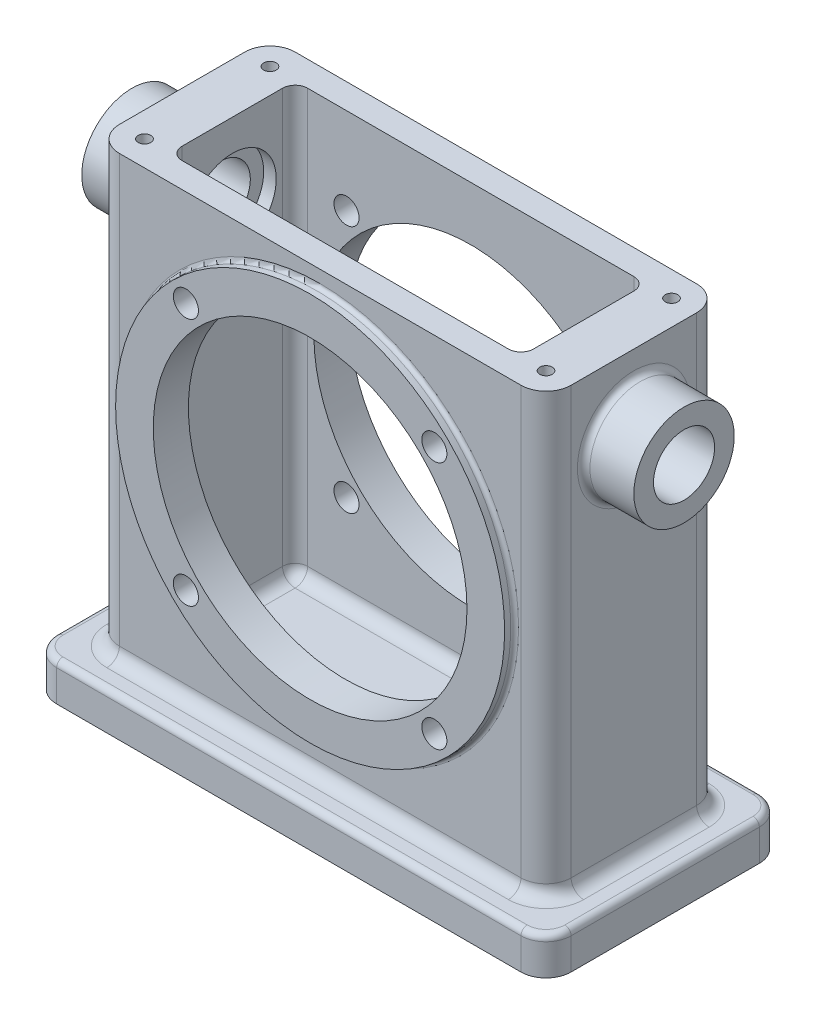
ISO-10303-21;
HEADER;
FILE_DESCRIPTION(('STEP AP214'),'2;1');
FILE_NAME('part.step','',(''),(''),'','','');
FILE_SCHEMA(('AUTOMOTIVE_DESIGN { 1 0 10303 214 1 1 1 1 }'));
ENDSEC;
DATA;
#1=APPLICATION_CONTEXT('core data for automotive mechanical design processes');
#2=APPLICATION_PROTOCOL_DEFINITION('international standard','automotive_design',2000,#1);
#3=PRODUCT_CONTEXT('',#1,'mechanical');
#4=PRODUCT('Part','Part','',(#3));
#5=PRODUCT_RELATED_PRODUCT_CATEGORY('part','',(#4));
#6=PRODUCT_DEFINITION_FORMATION('','',#4);
#7=PRODUCT_DEFINITION_CONTEXT('part definition',#1,'design');
#8=PRODUCT_DEFINITION('design','',#6,#7);
#9=PRODUCT_DEFINITION_SHAPE('','',#8);
#10=(LENGTH_UNIT() NAMED_UNIT(*) SI_UNIT(.MILLI.,.METRE.));
#11=(NAMED_UNIT(*) PLANE_ANGLE_UNIT() SI_UNIT($,.RADIAN.));
#12=(NAMED_UNIT(*) SI_UNIT($,.STERADIAN.) SOLID_ANGLE_UNIT());
#13=UNCERTAINTY_MEASURE_WITH_UNIT(LENGTH_MEASURE(1.E-05),#10,'distance_accuracy_value','');
#14=(GEOMETRIC_REPRESENTATION_CONTEXT(3) GLOBAL_UNCERTAINTY_ASSIGNED_CONTEXT((#13)) GLOBAL_UNIT_ASSIGNED_CONTEXT((#10,
#11,#12)) REPRESENTATION_CONTEXT('',''));
#15=CARTESIAN_POINT('',(0.,0.,0.));
#16=DIRECTION('',(0.,0.,1.));
#17=DIRECTION('',(1.,0.,0.));
#18=AXIS2_PLACEMENT_3D('',#15,#16,#17);
#19=CARTESIAN_POINT('',(-57.15,120.65,22.225));
#20=DIRECTION('',(0.,-1.,0.));
#21=DIRECTION('',(0.,0.,-1.));
#22=AXIS2_PLACEMENT_3D('',#19,#20,#21);
#23=PLANE('',#22);
#24=CARTESIAN_POINT('',(-50.8,120.65,-15.875));
#25=DIRECTION('',(0.,-1.,0.));
#26=DIRECTION('',(0.,0.,1.));
#27=AXIS2_PLACEMENT_3D('',#24,#25,#26);
#28=CIRCLE('',#27,1.5875);
#29=CARTESIAN_POINT('',(-50.8,120.65,-14.2875));
#30=VERTEX_POINT('',#29);
#31=EDGE_CURVE('E1444',#30,#30,#28,.T.);
#32=ORIENTED_EDGE('',*,*,#31,.T.);
#33=EDGE_LOOP('',(#32));
#34=FACE_BOUND('',#33,.T.);
#35=CARTESIAN_POINT('',(50.8,120.65,15.875));
#36=DIRECTION('',(0.,1.,0.));
#37=DIRECTION('',(0.,0.,1.));
#38=AXIS2_PLACEMENT_3D('',#35,#36,#37);
#39=CIRCLE('',#38,1.5875);
#40=CARTESIAN_POINT('',(50.8,120.65,17.4625));
#41=VERTEX_POINT('',#40);
#42=EDGE_CURVE('E1454',#41,#41,#39,.T.);
#43=ORIENTED_EDGE('',*,*,#42,.F.);
#44=EDGE_LOOP('',(#43));
#45=FACE_BOUND('',#44,.T.);
#46=CARTESIAN_POINT('',(50.8,120.65,-15.875));
#47=DIRECTION('',(0.,1.,0.));
#48=DIRECTION('',(0.,0.,1.));
#49=AXIS2_PLACEMENT_3D('',#46,#47,#48);
#50=CIRCLE('',#49,1.5875);
#51=CARTESIAN_POINT('',(50.8,120.65,-14.2875));
#52=VERTEX_POINT('',#51);
#53=EDGE_CURVE('E1460',#52,#52,#50,.T.);
#54=ORIENTED_EDGE('',*,*,#53,.F.);
#55=EDGE_LOOP('',(#54));
#56=FACE_BOUND('',#55,.T.);
#57=DIRECTION('',(0.,0.,-1.));
#58=VECTOR('',#57,1.);
#59=CARTESIAN_POINT('',(44.45,120.65,12.7));
#60=LINE('',#59,#58);
#61=CARTESIAN_POINT('',(44.45,120.65,12.7));
#62=VERTEX_POINT('',#61);
#63=CARTESIAN_POINT('',(44.45,120.65,-12.7));
#64=VERTEX_POINT('',#63);
#65=EDGE_CURVE('E261',#62,#64,#60,.T.);
#66=ORIENTED_EDGE('',*,*,#65,.F.);
#67=CARTESIAN_POINT('',(41.275,120.65,12.7));
#68=DIRECTION('',(0.,1.,0.));
#69=DIRECTION('',(0.,0.,1.));
#70=AXIS2_PLACEMENT_3D('',#67,#68,#69);
#71=CIRCLE('',#70,3.175);
#72=CARTESIAN_POINT('',(41.275,120.65,15.875));
#73=VERTEX_POINT('',#72);
#74=EDGE_CURVE('E266',#73,#62,#71,.T.);
#75=ORIENTED_EDGE('',*,*,#74,.F.);
#76=DIRECTION('',(1.,0.,0.));
#77=VECTOR('',#76,1.);
#78=CARTESIAN_POINT('',(-41.275,120.65,15.875));
#79=LINE('',#78,#77);
#80=CARTESIAN_POINT('',(-41.275,120.65,15.875));
#81=VERTEX_POINT('',#80);
#82=EDGE_CURVE('E285',#81,#73,#79,.T.);
#83=ORIENTED_EDGE('',*,*,#82,.F.);
#84=CARTESIAN_POINT('',(-41.275,120.65,12.7));
#85=DIRECTION('',(0.,1.,0.));
#86=DIRECTION('',(0.,0.,1.));
#87=AXIS2_PLACEMENT_3D('',#84,#85,#86);
#88=CIRCLE('',#87,3.175);
#89=CARTESIAN_POINT('',(-44.45,120.65,12.7));
#90=VERTEX_POINT('',#89);
#91=EDGE_CURVE('E282',#90,#81,#88,.T.);
#92=ORIENTED_EDGE('',*,*,#91,.F.);
#93=DIRECTION('',(0.,0.,1.));
#94=VECTOR('',#93,1.);
#95=CARTESIAN_POINT('',(-44.45,120.65,-12.7));
#96=LINE('',#95,#94);
#97=CARTESIAN_POINT('',(-44.45,120.65,-12.7));
#98=VERTEX_POINT('',#97);
#99=EDGE_CURVE('E279',#98,#90,#96,.T.);
#100=ORIENTED_EDGE('',*,*,#99,.F.);
#101=CARTESIAN_POINT('',(-41.275,120.65,-12.7));
#102=DIRECTION('',(0.,1.,0.));
#103=DIRECTION('',(0.,0.,1.));
#104=AXIS2_PLACEMENT_3D('',#101,#102,#103);
#105=CIRCLE('',#104,3.175);
#106=CARTESIAN_POINT('',(-41.275,120.65,-15.875));
#107=VERTEX_POINT('',#106);
#108=EDGE_CURVE('E273',#107,#98,#105,.T.);
#109=ORIENTED_EDGE('',*,*,#108,.F.);
#110=DIRECTION('',(-1.,0.,0.));
#111=VECTOR('',#110,1.);
#112=CARTESIAN_POINT('',(41.275,120.65,-15.875));
#113=LINE('',#112,#111);
#114=CARTESIAN_POINT('',(41.275,120.65,-15.875));
#115=VERTEX_POINT('',#114);
#116=EDGE_CURVE('E271',#115,#107,#113,.T.);
#117=ORIENTED_EDGE('',*,*,#116,.F.);
#118=CARTESIAN_POINT('',(41.275,120.65,-12.7));
#119=DIRECTION('',(0.,1.,0.));
#120=DIRECTION('',(0.,0.,1.));
#121=AXIS2_PLACEMENT_3D('',#118,#119,#120);
#122=CIRCLE('',#121,3.175);
#123=EDGE_CURVE('E254',#64,#115,#122,.T.);
#124=ORIENTED_EDGE('',*,*,#123,.F.);
#125=EDGE_LOOP('',(#66,#75,#83,#92,#100,#109,#117,#124));
#126=FACE_BOUND('',#125,.T.);
#127=DIRECTION('',(0.,0.,1.));
#128=VECTOR('',#127,1.);
#129=CARTESIAN_POINT('',(-57.15,120.65,22.225));
#130=LINE('',#129,#128);
#131=CARTESIAN_POINT('',(-57.15,120.65,-15.875));
#132=VERTEX_POINT('',#131);
#133=CARTESIAN_POINT('',(-57.15,120.65,15.875));
#134=VERTEX_POINT('',#133);
#135=EDGE_CURVE('E344',#132,#134,#130,.T.);
#136=ORIENTED_EDGE('',*,*,#135,.T.);
#137=CARTESIAN_POINT('',(-50.8,120.65,15.875));
#138=DIRECTION('',(0.,-1.,0.));
#139=DIRECTION('',(0.,0.,-1.));
#140=AXIS2_PLACEMENT_3D('',#137,#138,#139);
#141=CIRCLE('',#140,6.35);
#142=CARTESIAN_POINT('',(-50.8,120.65,22.225));
#143=VERTEX_POINT('',#142);
#144=EDGE_CURVE('E402',#134,#143,#141,.F.);
#145=ORIENTED_EDGE('',*,*,#144,.T.);
#146=DIRECTION('',(1.,0.,0.));
#147=VECTOR('',#146,1.);
#148=CARTESIAN_POINT('',(-57.15,120.65,22.225));
#149=LINE('',#148,#147);
#150=CARTESIAN_POINT('',(50.8,120.65,22.225));
#151=VERTEX_POINT('',#150);
#152=EDGE_CURVE('E347',#143,#151,#149,.T.);
#153=ORIENTED_EDGE('',*,*,#152,.T.);
#154=CARTESIAN_POINT('',(50.8,120.65,15.875));
#155=DIRECTION('',(0.,-1.,0.));
#156=DIRECTION('',(0.,0.,-1.));
#157=AXIS2_PLACEMENT_3D('',#154,#155,#156);
#158=CIRCLE('',#157,6.35);
#159=CARTESIAN_POINT('',(57.15,120.65,15.875));
#160=VERTEX_POINT('',#159);
#161=EDGE_CURVE('E398',#151,#160,#158,.F.);
#162=ORIENTED_EDGE('',*,*,#161,.T.);
#163=DIRECTION('',(0.,0.,-1.));
#164=VECTOR('',#163,1.);
#165=CARTESIAN_POINT('',(57.15,120.65,22.225));
#166=LINE('',#165,#164);
#167=CARTESIAN_POINT('',(57.15,120.65,-15.875));
#168=VERTEX_POINT('',#167);
#169=EDGE_CURVE('E350',#160,#168,#166,.T.);
#170=ORIENTED_EDGE('',*,*,#169,.T.);
#171=CARTESIAN_POINT('',(50.8,120.65,-15.875));
#172=DIRECTION('',(0.,-1.,0.));
#173=DIRECTION('',(0.,0.,-1.));
#174=AXIS2_PLACEMENT_3D('',#171,#172,#173);
#175=CIRCLE('',#174,6.35);
#176=CARTESIAN_POINT('',(50.8,120.65,-22.225));
#177=VERTEX_POINT('',#176);
#178=EDGE_CURVE('E396',#168,#177,#175,.F.);
#179=ORIENTED_EDGE('',*,*,#178,.T.);
#180=DIRECTION('',(-1.,0.,0.));
#181=VECTOR('',#180,1.);
#182=CARTESIAN_POINT('',(-57.15,120.65,-22.225));
#183=LINE('',#182,#181);
#184=CARTESIAN_POINT('',(-50.8,120.65,-22.225));
#185=VERTEX_POINT('',#184);
#186=EDGE_CURVE('E353',#177,#185,#183,.T.);
#187=ORIENTED_EDGE('',*,*,#186,.T.);
#188=CARTESIAN_POINT('',(-50.8,120.65,-15.875));
#189=DIRECTION('',(0.,-1.,0.));
#190=DIRECTION('',(0.,0.,-1.));
#191=AXIS2_PLACEMENT_3D('',#188,#189,#190);
#192=CIRCLE('',#191,6.35);
#193=EDGE_CURVE('E400',#185,#132,#192,.F.);
#194=ORIENTED_EDGE('',*,*,#193,.T.);
#195=EDGE_LOOP('',(#136,#145,#153,#162,#170,#179,#187,#194));
#196=FACE_BOUND('',#195,.T.);
#197=CARTESIAN_POINT('',(-50.8,120.65,15.875));
#198=DIRECTION('',(0.,-1.,0.));
#199=DIRECTION('',(0.,0.,1.));
#200=AXIS2_PLACEMENT_3D('',#197,#198,#199);
#201=CIRCLE('',#200,1.5875);
#202=CARTESIAN_POINT('',(-50.8,120.65,17.4625));
#203=VERTEX_POINT('',#202);
#204=EDGE_CURVE('E1445',#203,#203,#201,.T.);
#205=ORIENTED_EDGE('',*,*,#204,.T.);
#206=EDGE_LOOP('',(#205));
#207=FACE_BOUND('',#206,.T.);
#208=ADVANCED_FACE('F28',(#34,#45,#56,#126,#196,#207),#23,.F.);
#209=CARTESIAN_POINT('',(-44.45,12.7,-12.7));
#210=DIRECTION('',(-1.,0.,0.));
#211=DIRECTION('',(0.,0.,1.));
#212=AXIS2_PLACEMENT_3D('',#209,#210,#211);
#213=PLANE('',#212);
#214=DIRECTION('',(0.,1.,0.));
#215=VECTOR('',#214,1.);
#216=CARTESIAN_POINT('',(-44.45,12.7,12.7));
#217=LINE('',#216,#215);
#218=CARTESIAN_POINT('',(-44.45,15.875,12.7));
#219=VERTEX_POINT('',#218);
#220=EDGE_CURVE('E293',#219,#90,#217,.T.);
#221=ORIENTED_EDGE('',*,*,#220,.F.);
#222=DIRECTION('',(0.,0.,1.));
#223=VECTOR('',#222,1.);
#224=CARTESIAN_POINT('',(-44.45,15.875,-12.7));
#225=LINE('',#224,#223);
#226=CARTESIAN_POINT('',(-44.45,15.875,-12.7));
#227=VERTEX_POINT('',#226);
#228=EDGE_CURVE('E506',#219,#227,#225,.F.);
#229=ORIENTED_EDGE('',*,*,#228,.T.);
#230=DIRECTION('',(0.,1.,0.));
#231=VECTOR('',#230,1.);
#232=CARTESIAN_POINT('',(-44.45,12.7,-12.7));
#233=LINE('',#232,#231);
#234=EDGE_CURVE('E295',#227,#98,#233,.T.);
#235=ORIENTED_EDGE('',*,*,#234,.T.);
#236=ORIENTED_EDGE('',*,*,#99,.T.);
#237=EDGE_LOOP('',(#221,#229,#235,#236));
#238=FACE_BOUND('',#237,.T.);
#239=CARTESIAN_POINT('',(-44.45,101.6,0.));
#240=DIRECTION('',(-1.,0.,0.));
#241=DIRECTION('',(0.,0.,1.));
#242=AXIS2_PLACEMENT_3D('',#239,#240,#241);
#243=CIRCLE('',#242,11.1125);
#244=CARTESIAN_POINT('',(-44.45,101.6,11.1125));
#245=VERTEX_POINT('',#244);
#246=EDGE_CURVE('E595',#245,#245,#243,.T.);
#247=ORIENTED_EDGE('',*,*,#246,.T.);
#248=EDGE_LOOP('',(#247));
#249=FACE_BOUND('',#248,.T.);
#250=ADVANCED_FACE('F666',(#238,#249),#213,.F.);
#251=CARTESIAN_POINT('',(-69.85,101.6,0.));
#252=DIRECTION('',(1.,0.,0.));
#253=DIRECTION('',(0.,0.,-1.));
#254=AXIS2_PLACEMENT_3D('',#251,#252,#253);
#255=CYLINDRICAL_SURFACE('',#254,7.7343);
#256=CARTESIAN_POINT('',(-69.85,101.6,0.));
#257=DIRECTION('',(-1.,0.,0.));
#258=DIRECTION('',(0.,0.,1.));
#259=AXIS2_PLACEMENT_3D('',#256,#257,#258);
#260=CIRCLE('',#259,7.7343);
#261=CARTESIAN_POINT('',(-69.85,101.6,7.73429999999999));
#262=VERTEX_POINT('',#261);
#263=EDGE_CURVE('E542',#262,#262,#260,.T.);
#264=ORIENTED_EDGE('',*,*,#263,.T.);
#265=EDGE_LOOP('',(#264));
#266=FACE_BOUND('',#265,.T.);
#267=CARTESIAN_POINT('',(-47.625,101.6,0.));
#268=DIRECTION('',(1.,0.,0.));
#269=DIRECTION('',(0.,0.,-1.));
#270=AXIS2_PLACEMENT_3D('',#267,#268,#269);
#271=CIRCLE('',#270,7.7343);
#272=CARTESIAN_POINT('',(-47.625,101.6,-7.7343));
#273=VERTEX_POINT('',#272);
#274=EDGE_CURVE('E539',#273,#273,#271,.T.);
#275=ORIENTED_EDGE('',*,*,#274,.T.);
#276=EDGE_LOOP('',(#275));
#277=FACE_BOUND('',#276,.T.);
#278=ADVANCED_FACE('F720',(#266,#277),#255,.F.);
#279=CARTESIAN_POINT('',(-69.85,101.6,0.));
#280=DIRECTION('',(-1.,0.,0.));
#281=DIRECTION('',(0.,0.,-1.));
#282=AXIS2_PLACEMENT_3D('',#279,#280,#281);
#283=PLANE('',#282);
#284=CARTESIAN_POINT('',(-69.85,101.6,0.));
#285=DIRECTION('',(1.,0.,0.));
#286=DIRECTION('',(0.,0.,-1.));
#287=AXIS2_PLACEMENT_3D('',#284,#285,#286);
#288=CIRCLE('',#287,12.7);
#289=CARTESIAN_POINT('',(-69.85,101.6,-12.7));
#290=VERTEX_POINT('',#289);
#291=EDGE_CURVE('E602',#290,#290,#288,.T.);
#292=ORIENTED_EDGE('',*,*,#291,.F.);
#293=EDGE_LOOP('',(#292));
#294=FACE_BOUND('',#293,.T.);
#295=ORIENTED_EDGE('',*,*,#263,.F.);
#296=EDGE_LOOP('',(#295));
#297=FACE_BOUND('',#296,.T.);
#298=ADVANCED_FACE('F1248',(#294,#297),#283,.T.);
#299=CARTESIAN_POINT('',(69.85,101.6,0.));
#300=DIRECTION('',(-1.,0.,0.));
#301=DIRECTION('',(0.,0.,1.));
#302=AXIS2_PLACEMENT_3D('',#299,#300,#301);
#303=CYLINDRICAL_SURFACE('',#302,7.7343);
#304=CARTESIAN_POINT('',(69.85,101.6,0.));
#305=DIRECTION('',(-1.,0.,0.));
#306=DIRECTION('',(0.,0.,1.));
#307=AXIS2_PLACEMENT_3D('',#304,#305,#306);
#308=CIRCLE('',#307,7.7343);
#309=CARTESIAN_POINT('',(69.85,101.6,7.73429999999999));
#310=VERTEX_POINT('',#309);
#311=EDGE_CURVE('E537',#310,#310,#308,.T.);
#312=ORIENTED_EDGE('',*,*,#311,.F.);
#313=EDGE_LOOP('',(#312));
#314=FACE_BOUND('',#313,.T.);
#315=CARTESIAN_POINT('',(47.625,101.6,0.));
#316=DIRECTION('',(-1.,0.,0.));
#317=DIRECTION('',(0.,0.,1.));
#318=AXIS2_PLACEMENT_3D('',#315,#316,#317);
#319=CIRCLE('',#318,7.7343);
#320=CARTESIAN_POINT('',(47.625,101.6,7.73429999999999));
#321=VERTEX_POINT('',#320);
#322=EDGE_CURVE('E534',#321,#321,#319,.F.);
#323=ORIENTED_EDGE('',*,*,#322,.F.);
#324=EDGE_LOOP('',(#323));
#325=FACE_BOUND('',#324,.T.);
#326=ADVANCED_FACE('F737',(#314,#325),#303,.F.);
#327=CARTESIAN_POINT('',(57.15,120.65,22.225));
#328=DIRECTION('',(-1.,0.,0.));
#329=DIRECTION('',(0.,0.,1.));
#330=AXIS2_PLACEMENT_3D('',#327,#328,#329);
#331=PLANE('',#330);
#332=CARTESIAN_POINT('',(57.15,101.6,0.));
#333=DIRECTION('',(-1.,0.,0.));
#334=DIRECTION('',(0.,0.,1.));
#335=AXIS2_PLACEMENT_3D('',#332,#333,#334);
#336=CIRCLE('',#335,14.2875);
#337=CARTESIAN_POINT('',(57.15,101.6,14.2875));
#338=VERTEX_POINT('',#337);
#339=EDGE_CURVE('E11',#338,#338,#336,.T.);
#340=ORIENTED_EDGE('',*,*,#339,.T.);
#341=EDGE_LOOP('',(#340));
#342=FACE_BOUND('',#341,.T.);
#343=DIRECTION('',(0.,-1.,0.));
#344=VECTOR('',#343,1.);
#345=CARTESIAN_POINT('',(57.15,120.65,15.875));
#346=LINE('',#345,#344);
#347=CARTESIAN_POINT('',(57.15,12.7,15.875));
#348=VERTEX_POINT('',#347);
#349=EDGE_CURVE('E411',#160,#348,#346,.T.);
#350=ORIENTED_EDGE('',*,*,#349,.T.);
#351=DIRECTION('',(0.,0.,-1.));
#352=VECTOR('',#351,1.);
#353=CARTESIAN_POINT('',(57.15,12.7,-15.875));
#354=LINE('',#353,#352);
#355=CARTESIAN_POINT('',(57.15,12.7,-15.875));
#356=VERTEX_POINT('',#355);
#357=EDGE_CURVE('E484',#348,#356,#354,.T.);
#358=ORIENTED_EDGE('',*,*,#357,.T.);
#359=DIRECTION('',(0.,-1.,0.));
#360=VECTOR('',#359,1.);
#361=CARTESIAN_POINT('',(57.15,120.65,-15.875));
#362=LINE('',#361,#360);
#363=EDGE_CURVE('E409',#356,#168,#362,.F.);
#364=ORIENTED_EDGE('',*,*,#363,.T.);
#365=ORIENTED_EDGE('',*,*,#169,.F.);
#366=EDGE_LOOP('',(#350,#358,#364,#365));
#367=FACE_BOUND('',#366,.T.);
#368=ADVANCED_FACE('F733',(#342,#367),#331,.F.);
#369=CARTESIAN_POINT('',(-57.15,120.65,22.225));
#370=DIRECTION('',(0.,0.,-1.));
#371=DIRECTION('',(-1.,0.,0.));
#372=AXIS2_PLACEMENT_3D('',#369,#370,#371);
#373=PLANE('',#372);
#374=CARTESIAN_POINT('',(0.,67.31,22.225));
#375=DIRECTION('',(0.,0.,-1.));
#376=DIRECTION('',(-1.,0.,0.));
#377=AXIS2_PLACEMENT_3D('',#374,#375,#376);
#378=CIRCLE('',#377,50.2031);
#379=CARTESIAN_POINT('',(-50.2031,67.31,22.225));
#380=VERTEX_POINT('',#379);
#381=EDGE_CURVE('E524',#380,#380,#378,.T.);
#382=ORIENTED_EDGE('',*,*,#381,.T.);
#383=EDGE_LOOP('',(#382));
#384=FACE_BOUND('',#383,.T.);
#385=DIRECTION('',(0.,-1.,0.));
#386=VECTOR('',#385,1.);
#387=CARTESIAN_POINT('',(-50.8,120.65,22.225));
#388=LINE('',#387,#386);
#389=CARTESIAN_POINT('',(-50.8,12.7,22.225));
#390=VERTEX_POINT('',#389);
#391=EDGE_CURVE('E388',#143,#390,#388,.T.);
#392=ORIENTED_EDGE('',*,*,#391,.T.);
#393=DIRECTION('',(1.,0.,0.));
#394=VECTOR('',#393,1.);
#395=CARTESIAN_POINT('',(50.8,12.7,22.225));
#396=LINE('',#395,#394);
#397=CARTESIAN_POINT('',(50.8,12.7,22.225));
#398=VERTEX_POINT('',#397);
#399=EDGE_CURVE('E490',#390,#398,#396,.T.);
#400=ORIENTED_EDGE('',*,*,#399,.T.);
#401=DIRECTION('',(0.,-1.,0.));
#402=VECTOR('',#401,1.);
#403=CARTESIAN_POINT('',(50.8,120.65,22.225));
#404=LINE('',#403,#402);
#405=EDGE_CURVE('E386',#398,#151,#404,.F.);
#406=ORIENTED_EDGE('',*,*,#405,.T.);
#407=ORIENTED_EDGE('',*,*,#152,.F.);
#408=EDGE_LOOP('',(#392,#400,#406,#407));
#409=FACE_BOUND('',#408,.T.);
#410=ADVANCED_FACE('F736',(#384,#409),#373,.F.);
#411=CARTESIAN_POINT('',(-65.0875,9.525,-30.1625));
#412=DIRECTION('',(0.,-1.,0.));
#413=DIRECTION('',(0.,0.,-1.));
#414=AXIS2_PLACEMENT_3D('',#411,#412,#413);
#415=PLANE('',#414);
#416=CARTESIAN_POINT('',(-50.8,9.525,-15.875));
#417=DIRECTION('',(0.,-1.,0.));
#418=DIRECTION('',(0.,0.,-1.));
#419=AXIS2_PLACEMENT_3D('',#416,#417,#418);
#420=CIRCLE('',#419,9.525);
#421=CARTESIAN_POINT('',(-60.325,9.525,-15.875));
#422=VERTEX_POINT('',#421);
#423=CARTESIAN_POINT('',(-50.8,9.525,-25.4));
#424=VERTEX_POINT('',#423);
#425=EDGE_CURVE('E473',#422,#424,#420,.T.);
#426=ORIENTED_EDGE('',*,*,#425,.T.);
#427=DIRECTION('',(-1.,0.,0.));
#428=VECTOR('',#427,1.);
#429=CARTESIAN_POINT('',(50.8,9.525,-25.4));
#430=LINE('',#429,#428);
#431=CARTESIAN_POINT('',(50.8,9.525,-25.4));
#432=VERTEX_POINT('',#431);
#433=EDGE_CURVE('E475',#424,#432,#430,.F.);
#434=ORIENTED_EDGE('',*,*,#433,.T.);
#435=CARTESIAN_POINT('',(50.8,9.525,-15.875));
#436=DIRECTION('',(0.,-1.,0.));
#437=DIRECTION('',(0.,0.,-1.));
#438=AXIS2_PLACEMENT_3D('',#435,#436,#437);
#439=CIRCLE('',#438,9.525);
#440=CARTESIAN_POINT('',(60.325,9.525,-15.875));
#441=VERTEX_POINT('',#440);
#442=EDGE_CURVE('E471',#432,#441,#439,.T.);
#443=ORIENTED_EDGE('',*,*,#442,.T.);
#444=DIRECTION('',(0.,0.,-1.));
#445=VECTOR('',#444,1.);
#446=CARTESIAN_POINT('',(60.325,9.525,15.875));
#447=LINE('',#446,#445);
#448=CARTESIAN_POINT('',(60.325,9.525,15.875));
#449=VERTEX_POINT('',#448);
#450=EDGE_CURVE('E467',#441,#449,#447,.F.);
#451=ORIENTED_EDGE('',*,*,#450,.T.);
#452=CARTESIAN_POINT('',(50.8,9.525,15.875));
#453=DIRECTION('',(0.,-1.,0.));
#454=DIRECTION('',(0.,0.,-1.));
#455=AXIS2_PLACEMENT_3D('',#452,#453,#454);
#456=CIRCLE('',#455,9.525);
#457=CARTESIAN_POINT('',(50.8,9.525,25.4));
#458=VERTEX_POINT('',#457);
#459=EDGE_CURVE('E463',#449,#458,#456,.T.);
#460=ORIENTED_EDGE('',*,*,#459,.T.);
#461=DIRECTION('',(1.,0.,0.));
#462=VECTOR('',#461,1.);
#463=CARTESIAN_POINT('',(-50.8,9.525,25.4));
#464=LINE('',#463,#462);
#465=CARTESIAN_POINT('',(-50.8,9.525,25.4));
#466=VERTEX_POINT('',#465);
#467=EDGE_CURVE('E461',#458,#466,#464,.F.);
#468=ORIENTED_EDGE('',*,*,#467,.T.);
#469=CARTESIAN_POINT('',(-50.8,9.525,15.875));
#470=DIRECTION('',(0.,-1.,0.));
#471=DIRECTION('',(0.,0.,-1.));
#472=AXIS2_PLACEMENT_3D('',#469,#470,#471);
#473=CIRCLE('',#472,9.525);
#474=CARTESIAN_POINT('',(-60.325,9.525,15.875));
#475=VERTEX_POINT('',#474);
#476=EDGE_CURVE('E465',#466,#475,#473,.T.);
#477=ORIENTED_EDGE('',*,*,#476,.T.);
#478=DIRECTION('',(0.,0.,1.));
#479=VECTOR('',#478,1.);
#480=CARTESIAN_POINT('',(-60.325,9.525,-15.875));
#481=LINE('',#480,#479);
#482=EDGE_CURVE('E469',#475,#422,#481,.F.);
#483=ORIENTED_EDGE('',*,*,#482,.T.);
#484=EDGE_LOOP('',(#426,#434,#443,#451,#460,#468,#477,#483));
#485=FACE_BOUND('',#484,.T.);
#486=CARTESIAN_POINT('',(-58.7375,9.525,23.8125));
#487=DIRECTION('',(0.,-1.,0.));
#488=DIRECTION('',(0.,0.,-1.));
#489=AXIS2_PLACEMENT_3D('',#486,#487,#488);
#490=CIRCLE('',#489,4.7625);
#491=CARTESIAN_POINT('',(-63.5,9.525,23.8125));
#492=VERTEX_POINT('',#491);
#493=CARTESIAN_POINT('',(-58.7375,9.525,28.575));
#494=VERTEX_POINT('',#493);
#495=EDGE_CURVE('E434',#492,#494,#490,.F.);
#496=ORIENTED_EDGE('',*,*,#495,.T.);
#497=DIRECTION('',(1.,0.,0.));
#498=VECTOR('',#497,1.);
#499=CARTESIAN_POINT('',(-65.0875,9.525,28.575));
#500=LINE('',#499,#498);
#501=CARTESIAN_POINT('',(58.7375,9.525,28.575));
#502=VERTEX_POINT('',#501);
#503=EDGE_CURVE('E438',#494,#502,#500,.T.);
#504=ORIENTED_EDGE('',*,*,#503,.T.);
#505=CARTESIAN_POINT('',(58.7375,9.525,23.8125));
#506=DIRECTION('',(0.,-1.,0.));
#507=DIRECTION('',(0.,0.,-1.));
#508=AXIS2_PLACEMENT_3D('',#505,#506,#507);
#509=CIRCLE('',#508,4.7625);
#510=CARTESIAN_POINT('',(63.5,9.525,23.8125));
#511=VERTEX_POINT('',#510);
#512=EDGE_CURVE('E436',#502,#511,#509,.F.);
#513=ORIENTED_EDGE('',*,*,#512,.T.);
#514=DIRECTION('',(0.,0.,-1.));
#515=VECTOR('',#514,1.);
#516=CARTESIAN_POINT('',(63.5,9.525,-30.1625));
#517=LINE('',#516,#515);
#518=CARTESIAN_POINT('',(63.5,9.525,-23.8125));
#519=VERTEX_POINT('',#518);
#520=EDGE_CURVE('E432',#511,#519,#517,.T.);
#521=ORIENTED_EDGE('',*,*,#520,.T.);
#522=CARTESIAN_POINT('',(58.7375,9.525,-23.8125));
#523=DIRECTION('',(0.,-1.,0.));
#524=DIRECTION('',(0.,0.,-1.));
#525=AXIS2_PLACEMENT_3D('',#522,#523,#524);
#526=CIRCLE('',#525,4.7625);
#527=CARTESIAN_POINT('',(58.7375,9.525,-28.575));
#528=VERTEX_POINT('',#527);
#529=EDGE_CURVE('E428',#519,#528,#526,.F.);
#530=ORIENTED_EDGE('',*,*,#529,.T.);
#531=DIRECTION('',(-1.,0.,0.));
#532=VECTOR('',#531,1.);
#533=CARTESIAN_POINT('',(-65.0875,9.525,-28.575));
#534=LINE('',#533,#532);
#535=CARTESIAN_POINT('',(-58.7375,9.525,-28.575));
#536=VERTEX_POINT('',#535);
#537=EDGE_CURVE('E424',#528,#536,#534,.T.);
#538=ORIENTED_EDGE('',*,*,#537,.T.);
#539=CARTESIAN_POINT('',(-58.7375,9.525,-23.8125));
#540=DIRECTION('',(0.,-1.,0.));
#541=DIRECTION('',(0.,0.,-1.));
#542=AXIS2_PLACEMENT_3D('',#539,#540,#541);
#543=CIRCLE('',#542,4.7625);
#544=CARTESIAN_POINT('',(-63.5,9.525,-23.8125));
#545=VERTEX_POINT('',#544);
#546=EDGE_CURVE('E426',#536,#545,#543,.F.);
#547=ORIENTED_EDGE('',*,*,#546,.T.);
#548=DIRECTION('',(0.,0.,1.));
#549=VECTOR('',#548,1.);
#550=CARTESIAN_POINT('',(-63.5,9.525,-30.1625));
#551=LINE('',#550,#549);
#552=EDGE_CURVE('E430',#545,#492,#551,.T.);
#553=ORIENTED_EDGE('',*,*,#552,.T.);
#554=EDGE_LOOP('',(#496,#504,#513,#521,#530,#538,#547,#553));
#555=FACE_BOUND('',#554,.T.);
#556=ADVANCED_FACE('F741',(#485,#555),#415,.F.);
#557=CARTESIAN_POINT('',(-65.0875,9.525,30.1625));
#558=DIRECTION('',(1.,0.,0.));
#559=DIRECTION('',(0.,0.,-1.));
#560=AXIS2_PLACEMENT_3D('',#557,#558,#559);
#561=PLANE('',#560);
#562=DIRECTION('',(0.,-1.,0.));
#563=VECTOR('',#562,1.);
#564=CARTESIAN_POINT('',(-65.0875,9.525,23.8125));
#565=LINE('',#564,#563);
#566=CARTESIAN_POINT('',(-65.0875,0.,23.8125));
#567=VERTEX_POINT('',#566);
#568=CARTESIAN_POINT('',(-65.0875,7.9375,23.8125));
#569=VERTEX_POINT('',#568);
#570=EDGE_CURVE('E383',#567,#569,#565,.F.);
#571=ORIENTED_EDGE('',*,*,#570,.T.);
#572=DIRECTION('',(0.,0.,1.));
#573=VECTOR('',#572,1.);
#574=CARTESIAN_POINT('',(-65.0875,7.9375,30.1625));
#575=LINE('',#574,#573);
#576=CARTESIAN_POINT('',(-65.0875,7.9375,-23.8125));
#577=VERTEX_POINT('',#576);
#578=EDGE_CURVE('E450',#569,#577,#575,.F.);
#579=ORIENTED_EDGE('',*,*,#578,.T.);
#580=DIRECTION('',(0.,-1.,0.));
#581=VECTOR('',#580,1.);
#582=CARTESIAN_POINT('',(-65.0875,9.525,-23.8125));
#583=LINE('',#582,#581);
#584=CARTESIAN_POINT('',(-65.0875,0.,-23.8125));
#585=VERTEX_POINT('',#584);
#586=EDGE_CURVE('E381',#577,#585,#583,.T.);
#587=ORIENTED_EDGE('',*,*,#586,.T.);
#588=DIRECTION('',(0.,0.,1.));
#589=VECTOR('',#588,1.);
#590=CARTESIAN_POINT('',(-65.0875,0.,30.1625));
#591=LINE('',#590,#589);
#592=EDGE_CURVE('E356',#585,#567,#591,.T.);
#593=ORIENTED_EDGE('',*,*,#592,.T.);
#594=EDGE_LOOP('',(#571,#579,#587,#593));
#595=FACE_BOUND('',#594,.T.);
#596=ADVANCED_FACE('F30',(#595),#561,.F.);
#597=CARTESIAN_POINT('',(-65.0875,9.525,30.1625));
#598=DIRECTION('',(0.,0.,-1.));
#599=DIRECTION('',(-1.,0.,0.));
#600=AXIS2_PLACEMENT_3D('',#597,#598,#599);
#601=PLANE('',#600);
#602=DIRECTION('',(0.,-1.,0.));
#603=VECTOR('',#602,1.);
#604=CARTESIAN_POINT('',(58.7375,9.525,30.1625));
#605=LINE('',#604,#603);
#606=CARTESIAN_POINT('',(58.7375,0.,30.1625));
#607=VERTEX_POINT('',#606);
#608=CARTESIAN_POINT('',(58.7375,7.9375,30.1625));
#609=VERTEX_POINT('',#608);
#610=EDGE_CURVE('E368',#607,#609,#605,.F.);
#611=ORIENTED_EDGE('',*,*,#610,.T.);
#612=DIRECTION('',(1.,0.,0.));
#613=VECTOR('',#612,1.);
#614=CARTESIAN_POINT('',(-65.0875,7.9375,30.1625));
#615=LINE('',#614,#613);
#616=CARTESIAN_POINT('',(-58.7375,7.9375,30.1625));
#617=VERTEX_POINT('',#616);
#618=EDGE_CURVE('E441',#609,#617,#615,.F.);
#619=ORIENTED_EDGE('',*,*,#618,.T.);
#620=DIRECTION('',(0.,-1.,0.));
#621=VECTOR('',#620,1.);
#622=CARTESIAN_POINT('',(-58.7375,9.525,30.1625));
#623=LINE('',#622,#621);
#624=CARTESIAN_POINT('',(-58.7375,0.,30.1625));
#625=VERTEX_POINT('',#624);
#626=EDGE_CURVE('E371',#617,#625,#623,.T.);
#627=ORIENTED_EDGE('',*,*,#626,.T.);
#628=DIRECTION('',(1.,0.,0.));
#629=VECTOR('',#628,1.);
#630=CARTESIAN_POINT('',(-65.0875,0.,30.1625));
#631=LINE('',#630,#629);
#632=EDGE_CURVE('E359',#625,#607,#631,.T.);
#633=ORIENTED_EDGE('',*,*,#632,.T.);
#634=EDGE_LOOP('',(#611,#619,#627,#633));
#635=FACE_BOUND('',#634,.T.);
#636=ADVANCED_FACE('F759',(#635),#601,.F.);
#637=CARTESIAN_POINT('',(65.0875,9.525,30.1625));
#638=DIRECTION('',(-1.,0.,0.));
#639=DIRECTION('',(0.,0.,1.));
#640=AXIS2_PLACEMENT_3D('',#637,#638,#639);
#641=PLANE('',#640);
#642=DIRECTION('',(0.,-1.,0.));
#643=VECTOR('',#642,1.);
#644=CARTESIAN_POINT('',(65.0875,9.525,-23.8125));
#645=LINE('',#644,#643);
#646=CARTESIAN_POINT('',(65.0875,0.,-23.8125));
#647=VERTEX_POINT('',#646);
#648=CARTESIAN_POINT('',(65.0875,7.9375,-23.8125));
#649=VERTEX_POINT('',#648);
#650=EDGE_CURVE('E421',#647,#649,#645,.F.);
#651=ORIENTED_EDGE('',*,*,#650,.T.);
#652=DIRECTION('',(0.,0.,-1.));
#653=VECTOR('',#652,1.);
#654=CARTESIAN_POINT('',(65.0875,7.9375,30.1625));
#655=LINE('',#654,#653);
#656=CARTESIAN_POINT('',(65.0875,7.9375,23.8125));
#657=VERTEX_POINT('',#656);
#658=EDGE_CURVE('E448',#649,#657,#655,.F.);
#659=ORIENTED_EDGE('',*,*,#658,.T.);
#660=DIRECTION('',(0.,-1.,0.));
#661=VECTOR('',#660,1.);
#662=CARTESIAN_POINT('',(65.0875,9.525,23.8125));
#663=LINE('',#662,#661);
#664=CARTESIAN_POINT('',(65.0875,0.,23.8125));
#665=VERTEX_POINT('',#664);
#666=EDGE_CURVE('E419',#657,#665,#663,.T.);
#667=ORIENTED_EDGE('',*,*,#666,.T.);
#668=DIRECTION('',(0.,0.,-1.));
#669=VECTOR('',#668,1.);
#670=CARTESIAN_POINT('',(65.0875,0.,30.1625));
#671=LINE('',#670,#669);
#672=EDGE_CURVE('E362',#665,#647,#671,.T.);
#673=ORIENTED_EDGE('',*,*,#672,.T.);
#674=EDGE_LOOP('',(#651,#659,#667,#673));
#675=FACE_BOUND('',#674,.T.);
#676=ADVANCED_FACE('F756',(#675),#641,.F.);
#677=CARTESIAN_POINT('',(-65.0875,9.525,-30.1625));
#678=DIRECTION('',(0.,0.,1.));
#679=DIRECTION('',(1.,0.,0.));
#680=AXIS2_PLACEMENT_3D('',#677,#678,#679);
#681=PLANE('',#680);
#682=DIRECTION('',(0.,-1.,0.));
#683=VECTOR('',#682,1.);
#684=CARTESIAN_POINT('',(-58.7375,9.525,-30.1625));
#685=LINE('',#684,#683);
#686=CARTESIAN_POINT('',(-58.7375,0.,-30.1625));
#687=VERTEX_POINT('',#686);
#688=CARTESIAN_POINT('',(-58.7375,7.9375,-30.1625));
#689=VERTEX_POINT('',#688);
#690=EDGE_CURVE('E414',#687,#689,#685,.F.);
#691=ORIENTED_EDGE('',*,*,#690,.T.);
#692=DIRECTION('',(-1.,0.,0.));
#693=VECTOR('',#692,1.);
#694=CARTESIAN_POINT('',(-65.0875,7.9375,-30.1625));
#695=LINE('',#694,#693);
#696=CARTESIAN_POINT('',(58.7375,7.9375,-30.1625));
#697=VERTEX_POINT('',#696);
#698=EDGE_CURVE('E456',#689,#697,#695,.F.);
#699=ORIENTED_EDGE('',*,*,#698,.T.);
#700=DIRECTION('',(0.,-1.,0.));
#701=VECTOR('',#700,1.);
#702=CARTESIAN_POINT('',(58.7375,9.525,-30.1625));
#703=LINE('',#702,#701);
#704=CARTESIAN_POINT('',(58.7375,0.,-30.1625));
#705=VERTEX_POINT('',#704);
#706=EDGE_CURVE('E417',#697,#705,#703,.T.);
#707=ORIENTED_EDGE('',*,*,#706,.T.);
#708=DIRECTION('',(-1.,0.,0.));
#709=VECTOR('',#708,1.);
#710=CARTESIAN_POINT('',(-65.0875,0.,-30.1625));
#711=LINE('',#710,#709);
#712=EDGE_CURVE('E365',#705,#687,#711,.T.);
#713=ORIENTED_EDGE('',*,*,#712,.T.);
#714=EDGE_LOOP('',(#691,#699,#707,#713));
#715=FACE_BOUND('',#714,.T.);
#716=ADVANCED_FACE('F749',(#715),#681,.F.);
#717=CARTESIAN_POINT('',(-65.0875,0.,-30.1625));
#718=DIRECTION('',(0.,-1.,0.));
#719=DIRECTION('',(0.,0.,-1.));
#720=AXIS2_PLACEMENT_3D('',#717,#718,#719);
#721=PLANE('',#720);
#722=ORIENTED_EDGE('',*,*,#632,.F.);
#723=CARTESIAN_POINT('',(-58.7375,0.,23.8125));
#724=DIRECTION('',(0.,-1.,0.));
#725=DIRECTION('',(0.,0.,-1.));
#726=AXIS2_PLACEMENT_3D('',#723,#724,#725);
#727=CIRCLE('',#726,6.35);
#728=EDGE_CURVE('E379',#625,#567,#727,.T.);
#729=ORIENTED_EDGE('',*,*,#728,.T.);
#730=ORIENTED_EDGE('',*,*,#592,.F.);
#731=CARTESIAN_POINT('',(-58.7375,0.,-23.8125));
#732=DIRECTION('',(0.,-1.,0.));
#733=DIRECTION('',(0.,0.,-1.));
#734=AXIS2_PLACEMENT_3D('',#731,#732,#733);
#735=CIRCLE('',#734,6.35);
#736=EDGE_CURVE('E373',#585,#687,#735,.T.);
#737=ORIENTED_EDGE('',*,*,#736,.T.);
#738=ORIENTED_EDGE('',*,*,#712,.F.);
#739=CARTESIAN_POINT('',(58.7375,0.,-23.8125));
#740=DIRECTION('',(0.,-1.,0.));
#741=DIRECTION('',(0.,0.,-1.));
#742=AXIS2_PLACEMENT_3D('',#739,#740,#741);
#743=CIRCLE('',#742,6.35);
#744=EDGE_CURVE('E377',#705,#647,#743,.T.);
#745=ORIENTED_EDGE('',*,*,#744,.T.);
#746=ORIENTED_EDGE('',*,*,#672,.F.);
#747=CARTESIAN_POINT('',(58.7375,0.,23.8125));
#748=DIRECTION('',(0.,-1.,0.));
#749=DIRECTION('',(0.,0.,-1.));
#750=AXIS2_PLACEMENT_3D('',#747,#748,#749);
#751=CIRCLE('',#750,6.35);
#752=EDGE_CURVE('E375',#665,#607,#751,.T.);
#753=ORIENTED_EDGE('',*,*,#752,.T.);
#754=EDGE_LOOP('',(#722,#729,#730,#737,#738,#745,#746,#753));
#755=FACE_BOUND('',#754,.T.);
#756=ADVANCED_FACE('F745',(#755),#721,.T.);
#757=CARTESIAN_POINT('',(-57.15,120.65,22.225));
#758=DIRECTION('',(1.,0.,0.));
#759=DIRECTION('',(0.,0.,-1.));
#760=AXIS2_PLACEMENT_3D('',#757,#758,#759);
#761=PLANE('',#760);
#762=CARTESIAN_POINT('',(-57.15,101.6,0.));
#763=DIRECTION('',(1.,0.,0.));
#764=DIRECTION('',(0.,0.,-1.));
#765=AXIS2_PLACEMENT_3D('',#762,#763,#764);
#766=CIRCLE('',#765,14.2875);
#767=CARTESIAN_POINT('',(-57.15,101.6,-14.2875));
#768=VERTEX_POINT('',#767);
#769=EDGE_CURVE('E533',#768,#768,#766,.T.);
#770=ORIENTED_EDGE('',*,*,#769,.T.);
#771=EDGE_LOOP('',(#770));
#772=FACE_BOUND('',#771,.T.);
#773=DIRECTION('',(0.,-1.,0.));
#774=VECTOR('',#773,1.);
#775=CARTESIAN_POINT('',(-57.15,120.65,-15.875));
#776=LINE('',#775,#774);
#777=CARTESIAN_POINT('',(-57.15,12.7,-15.875));
#778=VERTEX_POINT('',#777);
#779=EDGE_CURVE('E391',#132,#778,#776,.T.);
#780=ORIENTED_EDGE('',*,*,#779,.T.);
#781=DIRECTION('',(0.,0.,1.));
#782=VECTOR('',#781,1.);
#783=CARTESIAN_POINT('',(-57.15,12.7,15.875));
#784=LINE('',#783,#782);
#785=CARTESIAN_POINT('',(-57.15,12.7,15.875));
#786=VERTEX_POINT('',#785);
#787=EDGE_CURVE('E482',#778,#786,#784,.T.);
#788=ORIENTED_EDGE('',*,*,#787,.T.);
#789=DIRECTION('',(0.,-1.,0.));
#790=VECTOR('',#789,1.);
#791=CARTESIAN_POINT('',(-57.15,120.65,15.875));
#792=LINE('',#791,#790);
#793=EDGE_CURVE('E394',#786,#134,#792,.F.);
#794=ORIENTED_EDGE('',*,*,#793,.T.);
#795=ORIENTED_EDGE('',*,*,#135,.F.);
#796=EDGE_LOOP('',(#780,#788,#794,#795));
#797=FACE_BOUND('',#796,.T.);
#798=ADVANCED_FACE('F731',(#772,#797),#761,.F.);
#799=CARTESIAN_POINT('',(-57.15,120.65,-22.225));
#800=DIRECTION('',(0.,0.,1.));
#801=DIRECTION('',(1.,0.,0.));
#802=AXIS2_PLACEMENT_3D('',#799,#800,#801);
#803=PLANE('',#802);
#804=CARTESIAN_POINT('',(0.,67.31,-22.225));
#805=DIRECTION('',(0.,0.,1.));
#806=DIRECTION('',(1.,0.,0.));
#807=AXIS2_PLACEMENT_3D('',#804,#805,#806);
#808=CIRCLE('',#807,50.2031);
#809=CARTESIAN_POINT('',(50.2031,67.31,-22.225));
#810=VERTEX_POINT('',#809);
#811=EDGE_CURVE('E527',#810,#810,#808,.T.);
#812=ORIENTED_EDGE('',*,*,#811,.T.);
#813=EDGE_LOOP('',(#812));
#814=FACE_BOUND('',#813,.T.);
#815=DIRECTION('',(0.,-1.,0.));
#816=VECTOR('',#815,1.);
#817=CARTESIAN_POINT('',(50.8,120.65,-22.225));
#818=LINE('',#817,#816);
#819=CARTESIAN_POINT('',(50.8,12.7,-22.225));
#820=VERTEX_POINT('',#819);
#821=EDGE_CURVE('E404',#177,#820,#818,.T.);
#822=ORIENTED_EDGE('',*,*,#821,.T.);
#823=DIRECTION('',(-1.,0.,0.));
#824=VECTOR('',#823,1.);
#825=CARTESIAN_POINT('',(-50.8,12.7,-22.225));
#826=LINE('',#825,#824);
#827=CARTESIAN_POINT('',(-50.8,12.7,-22.225));
#828=VERTEX_POINT('',#827);
#829=EDGE_CURVE('E458',#820,#828,#826,.T.);
#830=ORIENTED_EDGE('',*,*,#829,.T.);
#831=DIRECTION('',(0.,-1.,0.));
#832=VECTOR('',#831,1.);
#833=CARTESIAN_POINT('',(-50.8,120.65,-22.225));
#834=LINE('',#833,#832);
#835=EDGE_CURVE('E407',#828,#185,#834,.F.);
#836=ORIENTED_EDGE('',*,*,#835,.T.);
#837=ORIENTED_EDGE('',*,*,#186,.F.);
#838=EDGE_LOOP('',(#822,#830,#836,#837));
#839=FACE_BOUND('',#838,.T.);
#840=ADVANCED_FACE('F728',(#814,#839),#803,.F.);
#841=CARTESIAN_POINT('',(-58.7375,9.525,23.8125));
#842=DIRECTION('',(0.,-1.,0.));
#843=DIRECTION('',(0.,0.,-1.));
#844=AXIS2_PLACEMENT_3D('',#841,#842,#843);
#845=CYLINDRICAL_SURFACE('',#844,6.35);
#846=ORIENTED_EDGE('',*,*,#626,.F.);
#847=CARTESIAN_POINT('',(-58.7375,7.9375,23.8125));
#848=DIRECTION('',(0.,-1.,0.));
#849=DIRECTION('',(0.,0.,-1.));
#850=AXIS2_PLACEMENT_3D('',#847,#848,#849);
#851=CIRCLE('',#850,6.35);
#852=EDGE_CURVE('E446',#617,#569,#851,.T.);
#853=ORIENTED_EDGE('',*,*,#852,.T.);
#854=ORIENTED_EDGE('',*,*,#570,.F.);
#855=ORIENTED_EDGE('',*,*,#728,.F.);
#856=EDGE_LOOP('',(#846,#853,#854,#855));
#857=FACE_BOUND('',#856,.T.);
#858=ADVANCED_FACE('F726',(#857),#845,.T.);
#859=CARTESIAN_POINT('',(-50.8,120.65,15.875));
#860=DIRECTION('',(0.,-1.,0.));
#861=DIRECTION('',(0.,0.,-1.));
#862=AXIS2_PLACEMENT_3D('',#859,#860,#861);
#863=CYLINDRICAL_SURFACE('',#862,6.35);
#864=ORIENTED_EDGE('',*,*,#793,.F.);
#865=CARTESIAN_POINT('',(-50.8,12.7,15.875));
#866=DIRECTION('',(0.,-1.,0.));
#867=DIRECTION('',(0.,0.,-1.));
#868=AXIS2_PLACEMENT_3D('',#865,#866,#867);
#869=CIRCLE('',#868,6.35);
#870=EDGE_CURVE('E486',#786,#390,#869,.F.);
#871=ORIENTED_EDGE('',*,*,#870,.T.);
#872=ORIENTED_EDGE('',*,*,#391,.F.);
#873=ORIENTED_EDGE('',*,*,#144,.F.);
#874=EDGE_LOOP('',(#864,#871,#872,#873));
#875=FACE_BOUND('',#874,.T.);
#876=ADVANCED_FACE('F863',(#875),#863,.T.);
#877=CARTESIAN_POINT('',(-50.8,120.65,-15.875));
#878=DIRECTION('',(0.,-1.,0.));
#879=DIRECTION('',(0.,0.,-1.));
#880=AXIS2_PLACEMENT_3D('',#877,#878,#879);
#881=CYLINDRICAL_SURFACE('',#880,6.35);
#882=ORIENTED_EDGE('',*,*,#835,.F.);
#883=CARTESIAN_POINT('',(-50.8,12.7,-15.875));
#884=DIRECTION('',(0.,-1.,0.));
#885=DIRECTION('',(0.,0.,-1.));
#886=AXIS2_PLACEMENT_3D('',#883,#884,#885);
#887=CIRCLE('',#886,6.35);
#888=EDGE_CURVE('E478',#828,#778,#887,.F.);
#889=ORIENTED_EDGE('',*,*,#888,.T.);
#890=ORIENTED_EDGE('',*,*,#779,.F.);
#891=ORIENTED_EDGE('',*,*,#193,.F.);
#892=EDGE_LOOP('',(#882,#889,#890,#891));
#893=FACE_BOUND('',#892,.T.);
#894=ADVANCED_FACE('F860',(#893),#881,.T.);
#895=CARTESIAN_POINT('',(50.8,120.65,15.875));
#896=DIRECTION('',(0.,-1.,0.));
#897=DIRECTION('',(0.,0.,-1.));
#898=AXIS2_PLACEMENT_3D('',#895,#896,#897);
#899=CYLINDRICAL_SURFACE('',#898,6.35);
#900=ORIENTED_EDGE('',*,*,#405,.F.);
#901=CARTESIAN_POINT('',(50.8,12.7,15.875));
#902=DIRECTION('',(0.,-1.,0.));
#903=DIRECTION('',(0.,0.,-1.));
#904=AXIS2_PLACEMENT_3D('',#901,#902,#903);
#905=CIRCLE('',#904,6.35);
#906=EDGE_CURVE('E488',#398,#348,#905,.F.);
#907=ORIENTED_EDGE('',*,*,#906,.T.);
#908=ORIENTED_EDGE('',*,*,#349,.F.);
#909=ORIENTED_EDGE('',*,*,#161,.F.);
#910=EDGE_LOOP('',(#900,#907,#908,#909));
#911=FACE_BOUND('',#910,.T.);
#912=ADVANCED_FACE('F856',(#911),#899,.T.);
#913=CARTESIAN_POINT('',(50.8,120.65,-15.875));
#914=DIRECTION('',(0.,-1.,0.));
#915=DIRECTION('',(0.,0.,-1.));
#916=AXIS2_PLACEMENT_3D('',#913,#914,#915);
#917=CYLINDRICAL_SURFACE('',#916,6.35);
#918=ORIENTED_EDGE('',*,*,#363,.F.);
#919=CARTESIAN_POINT('',(50.8,12.7,-15.875));
#920=DIRECTION('',(0.,-1.,0.));
#921=DIRECTION('',(0.,0.,-1.));
#922=AXIS2_PLACEMENT_3D('',#919,#920,#921);
#923=CIRCLE('',#922,6.35);
#924=EDGE_CURVE('E480',#356,#820,#923,.F.);
#925=ORIENTED_EDGE('',*,*,#924,.T.);
#926=ORIENTED_EDGE('',*,*,#821,.F.);
#927=ORIENTED_EDGE('',*,*,#178,.F.);
#928=EDGE_LOOP('',(#918,#925,#926,#927));
#929=FACE_BOUND('',#928,.T.);
#930=ADVANCED_FACE('F853',(#929),#917,.T.);
#931=CARTESIAN_POINT('',(58.7375,9.525,-23.8125));
#932=DIRECTION('',(0.,-1.,0.));
#933=DIRECTION('',(0.,0.,-1.));
#934=AXIS2_PLACEMENT_3D('',#931,#932,#933);
#935=CYLINDRICAL_SURFACE('',#934,6.35);
#936=ORIENTED_EDGE('',*,*,#706,.F.);
#937=CARTESIAN_POINT('',(58.7375,7.9375,-23.8125));
#938=DIRECTION('',(0.,-1.,0.));
#939=DIRECTION('',(0.,0.,-1.));
#940=AXIS2_PLACEMENT_3D('',#937,#938,#939);
#941=CIRCLE('',#940,6.35);
#942=EDGE_CURVE('E452',#697,#649,#941,.T.);
#943=ORIENTED_EDGE('',*,*,#942,.T.);
#944=ORIENTED_EDGE('',*,*,#650,.F.);
#945=ORIENTED_EDGE('',*,*,#744,.F.);
#946=EDGE_LOOP('',(#936,#943,#944,#945));
#947=FACE_BOUND('',#946,.T.);
#948=ADVANCED_FACE('F824',(#947),#935,.T.);
#949=CARTESIAN_POINT('',(58.7375,9.525,23.8125));
#950=DIRECTION('',(0.,-1.,0.));
#951=DIRECTION('',(0.,0.,-1.));
#952=AXIS2_PLACEMENT_3D('',#949,#950,#951);
#953=CYLINDRICAL_SURFACE('',#952,6.35);
#954=ORIENTED_EDGE('',*,*,#666,.F.);
#955=CARTESIAN_POINT('',(58.7375,7.9375,23.8125));
#956=DIRECTION('',(0.,-1.,0.));
#957=DIRECTION('',(0.,0.,-1.));
#958=AXIS2_PLACEMENT_3D('',#955,#956,#957);
#959=CIRCLE('',#958,6.35);
#960=EDGE_CURVE('E444',#657,#609,#959,.T.);
#961=ORIENTED_EDGE('',*,*,#960,.T.);
#962=ORIENTED_EDGE('',*,*,#610,.F.);
#963=ORIENTED_EDGE('',*,*,#752,.F.);
#964=EDGE_LOOP('',(#954,#961,#962,#963));
#965=FACE_BOUND('',#964,.T.);
#966=ADVANCED_FACE('F828',(#965),#953,.T.);
#967=CARTESIAN_POINT('',(-58.7375,9.525,-23.8125));
#968=DIRECTION('',(0.,-1.,0.));
#969=DIRECTION('',(0.,0.,-1.));
#970=AXIS2_PLACEMENT_3D('',#967,#968,#969);
#971=CYLINDRICAL_SURFACE('',#970,6.35);
#972=ORIENTED_EDGE('',*,*,#586,.F.);
#973=CARTESIAN_POINT('',(-58.7375,7.9375,-23.8125));
#974=DIRECTION('',(0.,-1.,0.));
#975=DIRECTION('',(0.,0.,-1.));
#976=AXIS2_PLACEMENT_3D('',#973,#974,#975);
#977=CIRCLE('',#976,6.35);
#978=EDGE_CURVE('E454',#577,#689,#977,.T.);
#979=ORIENTED_EDGE('',*,*,#978,.T.);
#980=ORIENTED_EDGE('',*,*,#690,.F.);
#981=ORIENTED_EDGE('',*,*,#736,.F.);
#982=EDGE_LOOP('',(#972,#979,#980,#981));
#983=FACE_BOUND('',#982,.T.);
#984=ADVANCED_FACE('F807',(#983),#971,.T.);
#985=CARTESIAN_POINT('',(-65.0875,7.9375,-28.575));
#986=DIRECTION('',(-1.,0.,0.));
#987=DIRECTION('',(0.,0.,1.));
#988=AXIS2_PLACEMENT_3D('',#985,#986,#987);
#989=CYLINDRICAL_SURFACE('',#988,1.5875);
#990=CARTESIAN_POINT('',(58.7375,7.9375,-28.575));
#991=DIRECTION('',(1.,0.,0.));
#992=DIRECTION('',(0.,0.,-1.));
#993=AXIS2_PLACEMENT_3D('',#990,#991,#992);
#994=CIRCLE('',#993,1.5875);
#995=EDGE_CURVE('E338',#697,#528,#994,.T.);
#996=ORIENTED_EDGE('',*,*,#995,.F.);
#997=ORIENTED_EDGE('',*,*,#698,.F.);
#998=CARTESIAN_POINT('',(-58.7375,7.9375,-28.575));
#999=DIRECTION('',(-1.,0.,0.));
#1000=DIRECTION('',(0.,0.,1.));
#1001=AXIS2_PLACEMENT_3D('',#998,#999,#1000);
#1002=CIRCLE('',#1001,1.5875);
#1003=EDGE_CURVE('E341',#536,#689,#1002,.T.);
#1004=ORIENTED_EDGE('',*,*,#1003,.F.);
#1005=ORIENTED_EDGE('',*,*,#537,.F.);
#1006=EDGE_LOOP('',(#996,#997,#1004,#1005));
#1007=FACE_BOUND('',#1006,.T.);
#1008=ADVANCED_FACE('F814',(#1007),#989,.T.);
#1009=CARTESIAN_POINT('',(-58.7375,7.9375,-23.8125));
#1010=DIRECTION('',(0.,-1.,0.));
#1011=DIRECTION('',(0.,0.,-1.));
#1012=AXIS2_PLACEMENT_3D('',#1009,#1010,#1011);
#1013=TOROIDAL_SURFACE('',#1012,4.7625,1.5875);
#1014=ORIENTED_EDGE('',*,*,#1003,.T.);
#1015=ORIENTED_EDGE('',*,*,#978,.F.);
#1016=CARTESIAN_POINT('',(-63.5,7.9375,-23.8125));
#1017=DIRECTION('',(0.,0.,1.));
#1018=DIRECTION('',(1.,0.,0.));
#1019=AXIS2_PLACEMENT_3D('',#1016,#1017,#1018);
#1020=CIRCLE('',#1019,1.5875);
#1021=EDGE_CURVE('E335',#545,#577,#1020,.T.);
#1022=ORIENTED_EDGE('',*,*,#1021,.F.);
#1023=ORIENTED_EDGE('',*,*,#546,.F.);
#1024=EDGE_LOOP('',(#1014,#1015,#1022,#1023));
#1025=FACE_BOUND('',#1024,.T.);
#1026=ADVANCED_FACE('F803',(#1025),#1013,.T.);
#1027=CARTESIAN_POINT('',(58.7375,7.9375,-23.8125));
#1028=DIRECTION('',(0.,-1.,0.));
#1029=DIRECTION('',(0.,0.,-1.));
#1030=AXIS2_PLACEMENT_3D('',#1027,#1028,#1029);
#1031=TOROIDAL_SURFACE('',#1030,4.7625,1.5875);
#1032=ORIENTED_EDGE('',*,*,#995,.T.);
#1033=ORIENTED_EDGE('',*,*,#529,.F.);
#1034=CARTESIAN_POINT('',(63.5,7.9375,-23.8125));
#1035=DIRECTION('',(0.,0.,1.));
#1036=DIRECTION('',(1.,0.,0.));
#1037=AXIS2_PLACEMENT_3D('',#1034,#1035,#1036);
#1038=CIRCLE('',#1037,1.5875);
#1039=EDGE_CURVE('E332',#649,#519,#1038,.T.);
#1040=ORIENTED_EDGE('',*,*,#1039,.F.);
#1041=ORIENTED_EDGE('',*,*,#942,.F.);
#1042=EDGE_LOOP('',(#1032,#1033,#1040,#1041));
#1043=FACE_BOUND('',#1042,.T.);
#1044=ADVANCED_FACE('F820',(#1043),#1031,.T.);
#1045=CARTESIAN_POINT('',(-63.5,7.9375,-30.1625));
#1046=DIRECTION('',(0.,0.,1.));
#1047=DIRECTION('',(1.,0.,0.));
#1048=AXIS2_PLACEMENT_3D('',#1045,#1046,#1047);
#1049=CYLINDRICAL_SURFACE('',#1048,1.5875);
#1050=ORIENTED_EDGE('',*,*,#1021,.T.);
#1051=ORIENTED_EDGE('',*,*,#578,.F.);
#1052=CARTESIAN_POINT('',(-63.5,7.9375,23.8125));
#1053=DIRECTION('',(0.,0.,1.));
#1054=DIRECTION('',(1.,0.,0.));
#1055=AXIS2_PLACEMENT_3D('',#1052,#1053,#1054);
#1056=CIRCLE('',#1055,1.5875);
#1057=EDGE_CURVE('E329',#492,#569,#1056,.T.);
#1058=ORIENTED_EDGE('',*,*,#1057,.F.);
#1059=ORIENTED_EDGE('',*,*,#552,.F.);
#1060=EDGE_LOOP('',(#1050,#1051,#1058,#1059));
#1061=FACE_BOUND('',#1060,.T.);
#1062=ADVANCED_FACE('F798',(#1061),#1049,.T.);
#1063=CARTESIAN_POINT('',(63.5,7.9375,-30.1625));
#1064=DIRECTION('',(0.,0.,-1.));
#1065=DIRECTION('',(-1.,0.,0.));
#1066=AXIS2_PLACEMENT_3D('',#1063,#1064,#1065);
#1067=CYLINDRICAL_SURFACE('',#1066,1.5875);
#1068=ORIENTED_EDGE('',*,*,#1039,.T.);
#1069=ORIENTED_EDGE('',*,*,#520,.F.);
#1070=CARTESIAN_POINT('',(63.5,7.9375,23.8125));
#1071=DIRECTION('',(0.,0.,1.));
#1072=DIRECTION('',(1.,0.,0.));
#1073=AXIS2_PLACEMENT_3D('',#1070,#1071,#1072);
#1074=CIRCLE('',#1073,1.5875);
#1075=EDGE_CURVE('E326',#657,#511,#1074,.T.);
#1076=ORIENTED_EDGE('',*,*,#1075,.F.);
#1077=ORIENTED_EDGE('',*,*,#658,.F.);
#1078=EDGE_LOOP('',(#1068,#1069,#1076,#1077));
#1079=FACE_BOUND('',#1078,.T.);
#1080=ADVANCED_FACE('F830',(#1079),#1067,.T.);
#1081=CARTESIAN_POINT('',(-58.7375,7.9375,23.8125));
#1082=DIRECTION('',(0.,-1.,0.));
#1083=DIRECTION('',(0.,0.,-1.));
#1084=AXIS2_PLACEMENT_3D('',#1081,#1082,#1083);
#1085=TOROIDAL_SURFACE('',#1084,4.7625,1.5875);
#1086=ORIENTED_EDGE('',*,*,#1057,.T.);
#1087=ORIENTED_EDGE('',*,*,#852,.F.);
#1088=CARTESIAN_POINT('',(-58.7375,7.9375,28.575));
#1089=DIRECTION('',(1.,0.,0.));
#1090=DIRECTION('',(0.,0.,-1.));
#1091=AXIS2_PLACEMENT_3D('',#1088,#1089,#1090);
#1092=CIRCLE('',#1091,1.5875);
#1093=EDGE_CURVE('E324',#494,#617,#1092,.T.);
#1094=ORIENTED_EDGE('',*,*,#1093,.F.);
#1095=ORIENTED_EDGE('',*,*,#495,.F.);
#1096=EDGE_LOOP('',(#1086,#1087,#1094,#1095));
#1097=FACE_BOUND('',#1096,.T.);
#1098=ADVANCED_FACE('F790',(#1097),#1085,.T.);
#1099=CARTESIAN_POINT('',(58.7375,7.9375,23.8125));
#1100=DIRECTION('',(0.,-1.,0.));
#1101=DIRECTION('',(0.,0.,-1.));
#1102=AXIS2_PLACEMENT_3D('',#1099,#1100,#1101);
#1103=TOROIDAL_SURFACE('',#1102,4.7625,1.5875);
#1104=ORIENTED_EDGE('',*,*,#1075,.T.);
#1105=ORIENTED_EDGE('',*,*,#512,.F.);
#1106=CARTESIAN_POINT('',(58.7375,7.9375,28.575));
#1107=DIRECTION('',(-1.,0.,0.));
#1108=DIRECTION('',(0.,0.,1.));
#1109=AXIS2_PLACEMENT_3D('',#1106,#1107,#1108);
#1110=CIRCLE('',#1109,1.5875);
#1111=EDGE_CURVE('E322',#609,#502,#1110,.T.);
#1112=ORIENTED_EDGE('',*,*,#1111,.F.);
#1113=ORIENTED_EDGE('',*,*,#960,.F.);
#1114=EDGE_LOOP('',(#1104,#1105,#1112,#1113));
#1115=FACE_BOUND('',#1114,.T.);
#1116=ADVANCED_FACE('F782',(#1115),#1103,.T.);
#1117=CARTESIAN_POINT('',(-65.0875,7.9375,28.575));
#1118=DIRECTION('',(1.,0.,0.));
#1119=DIRECTION('',(0.,0.,-1.));
#1120=AXIS2_PLACEMENT_3D('',#1117,#1118,#1119);
#1121=CYLINDRICAL_SURFACE('',#1120,1.5875);
#1122=ORIENTED_EDGE('',*,*,#1093,.T.);
#1123=ORIENTED_EDGE('',*,*,#618,.F.);
#1124=ORIENTED_EDGE('',*,*,#1111,.T.);
#1125=ORIENTED_EDGE('',*,*,#503,.F.);
#1126=EDGE_LOOP('',(#1122,#1123,#1124,#1125));
#1127=FACE_BOUND('',#1126,.T.);
#1128=ADVANCED_FACE('F775',(#1127),#1121,.T.);
#1129=CARTESIAN_POINT('',(-57.15,12.7,25.4));
#1130=DIRECTION('',(-1.,0.,0.));
#1131=DIRECTION('',(0.,0.,1.));
#1132=AXIS2_PLACEMENT_3D('',#1129,#1130,#1131);
#1133=CYLINDRICAL_SURFACE('',#1132,3.175);
#1134=CARTESIAN_POINT('',(-50.8,12.7,25.4));
#1135=DIRECTION('',(1.,0.,0.));
#1136=DIRECTION('',(0.,0.,-1.));
#1137=AXIS2_PLACEMENT_3D('',#1134,#1135,#1136);
#1138=CIRCLE('',#1137,3.175);
#1139=EDGE_CURVE('E316',#466,#390,#1138,.T.);
#1140=ORIENTED_EDGE('',*,*,#1139,.F.);
#1141=ORIENTED_EDGE('',*,*,#467,.F.);
#1142=CARTESIAN_POINT('',(50.8,12.7,25.4));
#1143=DIRECTION('',(-1.,0.,0.));
#1144=DIRECTION('',(0.,0.,1.));
#1145=AXIS2_PLACEMENT_3D('',#1142,#1143,#1144);
#1146=CIRCLE('',#1145,3.175);
#1147=EDGE_CURVE('E319',#398,#458,#1146,.T.);
#1148=ORIENTED_EDGE('',*,*,#1147,.F.);
#1149=ORIENTED_EDGE('',*,*,#399,.F.);
#1150=EDGE_LOOP('',(#1140,#1141,#1148,#1149));
#1151=FACE_BOUND('',#1150,.T.);
#1152=ADVANCED_FACE('F893',(#1151),#1133,.F.);
#1153=CARTESIAN_POINT('',(50.8,12.7,15.875));
#1154=DIRECTION('',(0.,-1.,0.));
#1155=DIRECTION('',(0.,0.,-1.));
#1156=AXIS2_PLACEMENT_3D('',#1153,#1154,#1155);
#1157=TOROIDAL_SURFACE('',#1156,9.525,3.175);
#1158=ORIENTED_EDGE('',*,*,#1147,.T.);
#1159=ORIENTED_EDGE('',*,*,#459,.F.);
#1160=CARTESIAN_POINT('',(60.325,12.7,15.875));
#1161=DIRECTION('',(0.,0.,1.));
#1162=DIRECTION('',(1.,0.,0.));
#1163=AXIS2_PLACEMENT_3D('',#1160,#1161,#1162);
#1164=CIRCLE('',#1163,3.175);
#1165=EDGE_CURVE('E313',#348,#449,#1164,.T.);
#1166=ORIENTED_EDGE('',*,*,#1165,.F.);
#1167=ORIENTED_EDGE('',*,*,#906,.F.);
#1168=EDGE_LOOP('',(#1158,#1159,#1166,#1167));
#1169=FACE_BOUND('',#1168,.T.);
#1170=ADVANCED_FACE('F945',(#1169),#1157,.F.);
#1171=CARTESIAN_POINT('',(-50.8,12.7,15.875));
#1172=DIRECTION('',(0.,-1.,0.));
#1173=DIRECTION('',(0.,0.,-1.));
#1174=AXIS2_PLACEMENT_3D('',#1171,#1172,#1173);
#1175=TOROIDAL_SURFACE('',#1174,9.525,3.175);
#1176=ORIENTED_EDGE('',*,*,#1139,.T.);
#1177=ORIENTED_EDGE('',*,*,#870,.F.);
#1178=CARTESIAN_POINT('',(-60.325,12.7,15.875));
#1179=DIRECTION('',(0.,0.,1.));
#1180=DIRECTION('',(1.,0.,0.));
#1181=AXIS2_PLACEMENT_3D('',#1178,#1179,#1180);
#1182=CIRCLE('',#1181,3.175);
#1183=EDGE_CURVE('E310',#475,#786,#1182,.T.);
#1184=ORIENTED_EDGE('',*,*,#1183,.F.);
#1185=ORIENTED_EDGE('',*,*,#476,.F.);
#1186=EDGE_LOOP('',(#1176,#1177,#1184,#1185));
#1187=FACE_BOUND('',#1186,.T.);
#1188=ADVANCED_FACE('F878',(#1187),#1175,.F.);
#1189=CARTESIAN_POINT('',(60.325,12.7,22.225));
#1190=DIRECTION('',(0.,0.,1.));
#1191=DIRECTION('',(1.,0.,0.));
#1192=AXIS2_PLACEMENT_3D('',#1189,#1190,#1191);
#1193=CYLINDRICAL_SURFACE('',#1192,3.175);
#1194=ORIENTED_EDGE('',*,*,#1165,.T.);
#1195=ORIENTED_EDGE('',*,*,#450,.F.);
#1196=CARTESIAN_POINT('',(60.325,12.7,-15.875));
#1197=DIRECTION('',(0.,0.,1.));
#1198=DIRECTION('',(1.,0.,0.));
#1199=AXIS2_PLACEMENT_3D('',#1196,#1197,#1198);
#1200=CIRCLE('',#1199,3.175);
#1201=EDGE_CURVE('E307',#356,#441,#1200,.T.);
#1202=ORIENTED_EDGE('',*,*,#1201,.F.);
#1203=ORIENTED_EDGE('',*,*,#357,.F.);
#1204=EDGE_LOOP('',(#1194,#1195,#1202,#1203));
#1205=FACE_BOUND('',#1204,.T.);
#1206=ADVANCED_FACE('F912',(#1205),#1193,.F.);
#1207=CARTESIAN_POINT('',(-60.325,12.7,22.225));
#1208=DIRECTION('',(0.,0.,-1.));
#1209=DIRECTION('',(-1.,0.,0.));
#1210=AXIS2_PLACEMENT_3D('',#1207,#1208,#1209);
#1211=CYLINDRICAL_SURFACE('',#1210,3.175);
#1212=ORIENTED_EDGE('',*,*,#1183,.T.);
#1213=ORIENTED_EDGE('',*,*,#787,.F.);
#1214=CARTESIAN_POINT('',(-60.325,12.7,-15.875));
#1215=DIRECTION('',(0.,0.,1.));
#1216=DIRECTION('',(1.,0.,0.));
#1217=AXIS2_PLACEMENT_3D('',#1214,#1215,#1216);
#1218=CIRCLE('',#1217,3.175);
#1219=EDGE_CURVE('E304',#422,#778,#1218,.T.);
#1220=ORIENTED_EDGE('',*,*,#1219,.F.);
#1221=ORIENTED_EDGE('',*,*,#482,.F.);
#1222=EDGE_LOOP('',(#1212,#1213,#1220,#1221));
#1223=FACE_BOUND('',#1222,.T.);
#1224=ADVANCED_FACE('F884',(#1223),#1211,.F.);
#1225=CARTESIAN_POINT('',(50.8,12.7,-15.875));
#1226=DIRECTION('',(0.,-1.,0.));
#1227=DIRECTION('',(0.,0.,-1.));
#1228=AXIS2_PLACEMENT_3D('',#1225,#1226,#1227);
#1229=TOROIDAL_SURFACE('',#1228,9.525,3.175);
#1230=ORIENTED_EDGE('',*,*,#1201,.T.);
#1231=ORIENTED_EDGE('',*,*,#442,.F.);
#1232=CARTESIAN_POINT('',(50.8,12.7,-25.4));
#1233=DIRECTION('',(1.,0.,0.));
#1234=DIRECTION('',(0.,0.,-1.));
#1235=AXIS2_PLACEMENT_3D('',#1232,#1233,#1234);
#1236=CIRCLE('',#1235,3.175);
#1237=EDGE_CURVE('E302',#820,#432,#1236,.T.);
#1238=ORIENTED_EDGE('',*,*,#1237,.F.);
#1239=ORIENTED_EDGE('',*,*,#924,.F.);
#1240=EDGE_LOOP('',(#1230,#1231,#1238,#1239));
#1241=FACE_BOUND('',#1240,.T.);
#1242=ADVANCED_FACE('F916',(#1241),#1229,.F.);
#1243=CARTESIAN_POINT('',(-50.8,12.7,-15.875));
#1244=DIRECTION('',(0.,-1.,0.));
#1245=DIRECTION('',(0.,0.,-1.));
#1246=AXIS2_PLACEMENT_3D('',#1243,#1244,#1245);
#1247=TOROIDAL_SURFACE('',#1246,9.525,3.175);
#1248=ORIENTED_EDGE('',*,*,#1219,.T.);
#1249=ORIENTED_EDGE('',*,*,#888,.F.);
#1250=CARTESIAN_POINT('',(-50.8,12.7,-25.4));
#1251=DIRECTION('',(-1.,0.,0.));
#1252=DIRECTION('',(0.,0.,1.));
#1253=AXIS2_PLACEMENT_3D('',#1250,#1251,#1252);
#1254=CIRCLE('',#1253,3.175);
#1255=EDGE_CURVE('E290',#424,#828,#1254,.T.);
#1256=ORIENTED_EDGE('',*,*,#1255,.F.);
#1257=ORIENTED_EDGE('',*,*,#425,.F.);
#1258=EDGE_LOOP('',(#1248,#1249,#1256,#1257));
#1259=FACE_BOUND('',#1258,.T.);
#1260=ADVANCED_FACE('F928',(#1259),#1247,.F.);
#1261=CARTESIAN_POINT('',(-57.15,12.7,-25.4));
#1262=DIRECTION('',(1.,0.,0.));
#1263=DIRECTION('',(0.,0.,-1.));
#1264=AXIS2_PLACEMENT_3D('',#1261,#1262,#1263);
#1265=CYLINDRICAL_SURFACE('',#1264,3.175);
#1266=ORIENTED_EDGE('',*,*,#1237,.T.);
#1267=ORIENTED_EDGE('',*,*,#433,.F.);
#1268=ORIENTED_EDGE('',*,*,#1255,.T.);
#1269=ORIENTED_EDGE('',*,*,#829,.F.);
#1270=EDGE_LOOP('',(#1266,#1267,#1268,#1269));
#1271=FACE_BOUND('',#1270,.T.);
#1272=ADVANCED_FACE('F919',(#1271),#1265,.F.);
#1273=CARTESIAN_POINT('',(41.275,12.7,12.7));
#1274=DIRECTION('',(0.,1.,0.));
#1275=DIRECTION('',(0.,0.,1.));
#1276=AXIS2_PLACEMENT_3D('',#1273,#1274,#1275);
#1277=CYLINDRICAL_SURFACE('',#1276,3.175);
#1278=DIRECTION('',(0.,1.,0.));
#1279=VECTOR('',#1278,1.);
#1280=CARTESIAN_POINT('',(44.45,12.7,12.7));
#1281=LINE('',#1280,#1279);
#1282=CARTESIAN_POINT('',(44.45,15.875,12.7));
#1283=VERTEX_POINT('',#1282);
#1284=EDGE_CURVE('E258',#1283,#62,#1281,.T.);
#1285=ORIENTED_EDGE('',*,*,#1284,.F.);
#1286=CARTESIAN_POINT('',(41.275,15.875,12.7));
#1287=DIRECTION('',(0.,1.,0.));
#1288=DIRECTION('',(0.,0.,1.));
#1289=AXIS2_PLACEMENT_3D('',#1286,#1287,#1288);
#1290=CIRCLE('',#1289,3.175);
#1291=CARTESIAN_POINT('',(41.275,15.875,15.875));
#1292=VERTEX_POINT('',#1291);
#1293=EDGE_CURVE('E514',#1283,#1292,#1290,.F.);
#1294=ORIENTED_EDGE('',*,*,#1293,.T.);
#1295=DIRECTION('',(0.,1.,0.));
#1296=VECTOR('',#1295,1.);
#1297=CARTESIAN_POINT('',(41.275,12.7,15.875));
#1298=LINE('',#1297,#1296);
#1299=EDGE_CURVE('E288',#1292,#73,#1298,.T.);
#1300=ORIENTED_EDGE('',*,*,#1299,.T.);
#1301=ORIENTED_EDGE('',*,*,#74,.T.);
#1302=EDGE_LOOP('',(#1285,#1294,#1300,#1301));
#1303=FACE_BOUND('',#1302,.T.);
#1304=ADVANCED_FACE('F650',(#1303),#1277,.F.);
#1305=CARTESIAN_POINT('',(-41.275,12.7,15.875));
#1306=DIRECTION('',(0.,0.,1.));
#1307=DIRECTION('',(1.,0.,0.));
#1308=AXIS2_PLACEMENT_3D('',#1305,#1306,#1307);
#1309=PLANE('',#1308);
#1310=CARTESIAN_POINT('',(31.4308964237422,35.8791035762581,15.875));
#1311=DIRECTION('',(0.,0.,1.));
#1312=DIRECTION('',(1.,0.,0.));
#1313=AXIS2_PLACEMENT_3D('',#1310,#1311,#1312);
#1314=CIRCLE('',#1313,3.17499999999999);
#1315=CARTESIAN_POINT('',(34.6058964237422,35.8791035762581,15.875));
#1316=VERTEX_POINT('',#1315);
#1317=EDGE_CURVE('E570',#1316,#1316,#1314,.T.);
#1318=ORIENTED_EDGE('',*,*,#1317,.T.);
#1319=EDGE_LOOP('',(#1318));
#1320=FACE_BOUND('',#1319,.T.);
#1321=CARTESIAN_POINT('',(-31.430896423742,35.8791035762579,15.875));
#1322=DIRECTION('',(0.,0.,1.));
#1323=DIRECTION('',(1.,0.,0.));
#1324=AXIS2_PLACEMENT_3D('',#1321,#1322,#1323);
#1325=CIRCLE('',#1324,3.17499999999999);
#1326=CARTESIAN_POINT('',(-28.255896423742,35.8791035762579,15.875));
#1327=VERTEX_POINT('',#1326);
#1328=EDGE_CURVE('E567',#1327,#1327,#1325,.T.);
#1329=ORIENTED_EDGE('',*,*,#1328,.T.);
#1330=EDGE_LOOP('',(#1329));
#1331=FACE_BOUND('',#1330,.T.);
#1332=CARTESIAN_POINT('',(-31.430896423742,98.7408964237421,15.875));
#1333=DIRECTION('',(0.,0.,1.));
#1334=DIRECTION('',(1.,0.,0.));
#1335=AXIS2_PLACEMENT_3D('',#1332,#1333,#1334);
#1336=CIRCLE('',#1335,3.17499999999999);
#1337=CARTESIAN_POINT('',(-28.255896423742,98.7408964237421,15.875));
#1338=VERTEX_POINT('',#1337);
#1339=EDGE_CURVE('E585',#1338,#1338,#1336,.T.);
#1340=ORIENTED_EDGE('',*,*,#1339,.T.);
#1341=EDGE_LOOP('',(#1340));
#1342=FACE_BOUND('',#1341,.T.);
#1343=CARTESIAN_POINT('',(31.4308964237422,98.7408964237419,15.875));
#1344=DIRECTION('',(0.,0.,1.));
#1345=DIRECTION('',(1.,0.,0.));
#1346=AXIS2_PLACEMENT_3D('',#1343,#1344,#1345);
#1347=CIRCLE('',#1346,3.17499999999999);
#1348=CARTESIAN_POINT('',(34.6058964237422,98.7408964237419,15.875));
#1349=VERTEX_POINT('',#1348);
#1350=EDGE_CURVE('E592',#1349,#1349,#1347,.T.);
#1351=ORIENTED_EDGE('',*,*,#1350,.T.);
#1352=EDGE_LOOP('',(#1351));
#1353=FACE_BOUND('',#1352,.T.);
#1354=CARTESIAN_POINT('',(0.,67.31,15.875));
#1355=DIRECTION('',(0.,0.,1.));
#1356=DIRECTION('',(1.,0.,0.));
#1357=AXIS2_PLACEMENT_3D('',#1354,#1355,#1356);
#1358=CIRCLE('',#1357,39.6875);
#1359=CARTESIAN_POINT('',(39.6875,67.31,15.875));
#1360=VERTEX_POINT('',#1359);
#1361=EDGE_CURVE('E619',#1360,#1360,#1358,.T.);
#1362=ORIENTED_EDGE('',*,*,#1361,.T.);
#1363=EDGE_LOOP('',(#1362));
#1364=FACE_BOUND('',#1363,.T.);
#1365=ORIENTED_EDGE('',*,*,#1299,.F.);
#1366=DIRECTION('',(1.,0.,0.));
#1367=VECTOR('',#1366,1.);
#1368=CARTESIAN_POINT('',(-41.275,15.875,15.875));
#1369=LINE('',#1368,#1367);
#1370=CARTESIAN_POINT('',(-41.275,15.875,15.875));
#1371=VERTEX_POINT('',#1370);
#1372=EDGE_CURVE('E501',#1292,#1371,#1369,.F.);
#1373=ORIENTED_EDGE('',*,*,#1372,.T.);
#1374=DIRECTION('',(0.,1.,0.));
#1375=VECTOR('',#1374,1.);
#1376=CARTESIAN_POINT('',(-41.275,12.7,15.875));
#1377=LINE('',#1376,#1375);
#1378=EDGE_CURVE('E291',#1371,#81,#1377,.T.);
#1379=ORIENTED_EDGE('',*,*,#1378,.T.);
#1380=ORIENTED_EDGE('',*,*,#82,.T.);
#1381=EDGE_LOOP('',(#1365,#1373,#1379,#1380));
#1382=FACE_BOUND('',#1381,.T.);
#1383=ADVANCED_FACE('F657',(#1320,#1331,#1342,#1353,#1364,#1382),#1309,.F.);
#1384=CARTESIAN_POINT('',(-41.275,12.7,12.7));
#1385=DIRECTION('',(0.,1.,0.));
#1386=DIRECTION('',(0.,0.,1.));
#1387=AXIS2_PLACEMENT_3D('',#1384,#1385,#1386);
#1388=CYLINDRICAL_SURFACE('',#1387,3.175);
#1389=ORIENTED_EDGE('',*,*,#1378,.F.);
#1390=CARTESIAN_POINT('',(-41.275,15.875,12.7));
#1391=DIRECTION('',(0.,1.,0.));
#1392=DIRECTION('',(0.,0.,1.));
#1393=AXIS2_PLACEMENT_3D('',#1390,#1391,#1392);
#1394=CIRCLE('',#1393,3.175);
#1395=EDGE_CURVE('E504',#1371,#219,#1394,.F.);
#1396=ORIENTED_EDGE('',*,*,#1395,.T.);
#1397=ORIENTED_EDGE('',*,*,#220,.T.);
#1398=ORIENTED_EDGE('',*,*,#91,.T.);
#1399=EDGE_LOOP('',(#1389,#1396,#1397,#1398));
#1400=FACE_BOUND('',#1399,.T.);
#1401=ADVANCED_FACE('F661',(#1400),#1388,.F.);
#1402=CARTESIAN_POINT('',(-41.275,12.7,-12.7));
#1403=DIRECTION('',(0.,1.,0.));
#1404=DIRECTION('',(0.,0.,1.));
#1405=AXIS2_PLACEMENT_3D('',#1402,#1403,#1404);
#1406=CYLINDRICAL_SURFACE('',#1405,3.175);
#1407=ORIENTED_EDGE('',*,*,#234,.F.);
#1408=CARTESIAN_POINT('',(-41.275,15.875,-12.7));
#1409=DIRECTION('',(0.,1.,0.));
#1410=DIRECTION('',(0.,0.,1.));
#1411=AXIS2_PLACEMENT_3D('',#1408,#1409,#1410);
#1412=CIRCLE('',#1411,3.175);
#1413=CARTESIAN_POINT('',(-41.275,15.875,-15.875));
#1414=VERTEX_POINT('',#1413);
#1415=EDGE_CURVE('E508',#227,#1414,#1412,.F.);
#1416=ORIENTED_EDGE('',*,*,#1415,.T.);
#1417=DIRECTION('',(0.,1.,0.));
#1418=VECTOR('',#1417,1.);
#1419=CARTESIAN_POINT('',(-41.275,12.7,-15.875));
#1420=LINE('',#1419,#1418);
#1421=EDGE_CURVE('E297',#1414,#107,#1420,.T.);
#1422=ORIENTED_EDGE('',*,*,#1421,.T.);
#1423=ORIENTED_EDGE('',*,*,#108,.T.);
#1424=EDGE_LOOP('',(#1407,#1416,#1422,#1423));
#1425=FACE_BOUND('',#1424,.T.);
#1426=ADVANCED_FACE('F670',(#1425),#1406,.F.);
#1427=CARTESIAN_POINT('',(41.275,12.7,-15.875));
#1428=DIRECTION('',(0.,0.,-1.));
#1429=DIRECTION('',(-1.,0.,0.));
#1430=AXIS2_PLACEMENT_3D('',#1427,#1428,#1429);
#1431=PLANE('',#1430);
#1432=CARTESIAN_POINT('',(31.4308964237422,35.8791035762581,-15.875));
#1433=DIRECTION('',(0.,0.,-1.));
#1434=DIRECTION('',(-1.,0.,0.));
#1435=AXIS2_PLACEMENT_3D('',#1432,#1433,#1434);
#1436=CIRCLE('',#1435,3.17499999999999);
#1437=CARTESIAN_POINT('',(28.2558964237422,35.8791035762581,-15.875));
#1438=VERTEX_POINT('',#1437);
#1439=EDGE_CURVE('E575',#1438,#1438,#1436,.T.);
#1440=ORIENTED_EDGE('',*,*,#1439,.T.);
#1441=EDGE_LOOP('',(#1440));
#1442=FACE_BOUND('',#1441,.T.);
#1443=CARTESIAN_POINT('',(-31.430896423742,35.8791035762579,-15.875));
#1444=DIRECTION('',(0.,0.,-1.));
#1445=DIRECTION('',(-1.,0.,0.));
#1446=AXIS2_PLACEMENT_3D('',#1443,#1444,#1445);
#1447=CIRCLE('',#1446,3.17499999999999);
#1448=CARTESIAN_POINT('',(-34.605896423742,35.8791035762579,-15.875));
#1449=VERTEX_POINT('',#1448);
#1450=EDGE_CURVE('E562',#1449,#1449,#1447,.T.);
#1451=ORIENTED_EDGE('',*,*,#1450,.T.);
#1452=EDGE_LOOP('',(#1451));
#1453=FACE_BOUND('',#1452,.T.);
#1454=CARTESIAN_POINT('',(-31.430896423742,98.7408964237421,-15.875));
#1455=DIRECTION('',(0.,0.,-1.));
#1456=DIRECTION('',(-1.,0.,0.));
#1457=AXIS2_PLACEMENT_3D('',#1454,#1455,#1456);
#1458=CIRCLE('',#1457,3.17499999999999);
#1459=CARTESIAN_POINT('',(-34.605896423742,98.7408964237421,-15.875));
#1460=VERTEX_POINT('',#1459);
#1461=EDGE_CURVE('E558',#1460,#1460,#1458,.T.);
#1462=ORIENTED_EDGE('',*,*,#1461,.T.);
#1463=EDGE_LOOP('',(#1462));
#1464=FACE_BOUND('',#1463,.T.);
#1465=CARTESIAN_POINT('',(31.4308964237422,98.7408964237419,-15.875));
#1466=DIRECTION('',(0.,0.,-1.));
#1467=DIRECTION('',(-1.,0.,0.));
#1468=AXIS2_PLACEMENT_3D('',#1465,#1466,#1467);
#1469=CIRCLE('',#1468,3.17499999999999);
#1470=CARTESIAN_POINT('',(28.2558964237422,98.7408964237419,-15.875));
#1471=VERTEX_POINT('',#1470);
#1472=EDGE_CURVE('E554',#1471,#1471,#1469,.T.);
#1473=ORIENTED_EDGE('',*,*,#1472,.T.);
#1474=EDGE_LOOP('',(#1473));
#1475=FACE_BOUND('',#1474,.T.);
#1476=CARTESIAN_POINT('',(0.,67.31,-15.875));
#1477=DIRECTION('',(0.,0.,-1.));
#1478=DIRECTION('',(-1.,0.,0.));
#1479=AXIS2_PLACEMENT_3D('',#1476,#1477,#1478);
#1480=CIRCLE('',#1479,39.6875);
#1481=CARTESIAN_POINT('',(-39.6875,67.31,-15.875));
#1482=VERTEX_POINT('',#1481);
#1483=EDGE_CURVE('E520',#1482,#1482,#1480,.T.);
#1484=ORIENTED_EDGE('',*,*,#1483,.T.);
#1485=EDGE_LOOP('',(#1484));
#1486=FACE_BOUND('',#1485,.T.);
#1487=ORIENTED_EDGE('',*,*,#1421,.F.);
#1488=DIRECTION('',(-1.,0.,0.));
#1489=VECTOR('',#1488,1.);
#1490=CARTESIAN_POINT('',(41.275,15.875,-15.875));
#1491=LINE('',#1490,#1489);
#1492=CARTESIAN_POINT('',(41.275,15.875,-15.875));
#1493=VERTEX_POINT('',#1492);
#1494=EDGE_CURVE('E510',#1414,#1493,#1491,.F.);
#1495=ORIENTED_EDGE('',*,*,#1494,.T.);
#1496=DIRECTION('',(0.,1.,0.));
#1497=VECTOR('',#1496,1.);
#1498=CARTESIAN_POINT('',(41.275,12.7,-15.875));
#1499=LINE('',#1498,#1497);
#1500=EDGE_CURVE('E257',#1493,#115,#1499,.T.);
#1501=ORIENTED_EDGE('',*,*,#1500,.T.);
#1502=ORIENTED_EDGE('',*,*,#116,.T.);
#1503=EDGE_LOOP('',(#1487,#1495,#1501,#1502));
#1504=FACE_BOUND('',#1503,.T.);
#1505=ADVANCED_FACE('F675',(#1442,#1453,#1464,#1475,#1486,#1504),#1431,.F.);
#1506=CARTESIAN_POINT('',(41.275,12.7,-12.7));
#1507=DIRECTION('',(0.,1.,0.));
#1508=DIRECTION('',(0.,0.,1.));
#1509=AXIS2_PLACEMENT_3D('',#1506,#1507,#1508);
#1510=CYLINDRICAL_SURFACE('',#1509,3.175);
#1511=ORIENTED_EDGE('',*,*,#1500,.F.);
#1512=CARTESIAN_POINT('',(41.275,15.875,-12.7));
#1513=DIRECTION('',(0.,1.,0.));
#1514=DIRECTION('',(0.,0.,1.));
#1515=AXIS2_PLACEMENT_3D('',#1512,#1513,#1514);
#1516=CIRCLE('',#1515,3.175);
#1517=CARTESIAN_POINT('',(44.45,15.875,-12.7));
#1518=VERTEX_POINT('',#1517);
#1519=EDGE_CURVE('E53',#1493,#1518,#1516,.F.);
#1520=ORIENTED_EDGE('',*,*,#1519,.T.);
#1521=DIRECTION('',(0.,1.,0.));
#1522=VECTOR('',#1521,1.);
#1523=CARTESIAN_POINT('',(44.45,12.7,-12.7));
#1524=LINE('',#1523,#1522);
#1525=EDGE_CURVE('E250',#1518,#64,#1524,.T.);
#1526=ORIENTED_EDGE('',*,*,#1525,.T.);
#1527=ORIENTED_EDGE('',*,*,#123,.T.);
#1528=EDGE_LOOP('',(#1511,#1520,#1526,#1527));
#1529=FACE_BOUND('',#1528,.T.);
#1530=ADVANCED_FACE('F252',(#1529),#1510,.F.);
#1531=CARTESIAN_POINT('',(44.45,12.7,12.7));
#1532=DIRECTION('',(1.,0.,0.));
#1533=DIRECTION('',(0.,0.,-1.));
#1534=AXIS2_PLACEMENT_3D('',#1531,#1532,#1533);
#1535=PLANE('',#1534);
#1536=CARTESIAN_POINT('',(44.45,101.6,0.));
#1537=DIRECTION('',(-1.,0.,0.));
#1538=DIRECTION('',(0.,0.,1.));
#1539=AXIS2_PLACEMENT_3D('',#1536,#1537,#1538);
#1540=CIRCLE('',#1539,11.1125);
#1541=CARTESIAN_POINT('',(44.45,101.6,11.1125));
#1542=VERTEX_POINT('',#1541);
#1543=EDGE_CURVE('E605',#1542,#1542,#1540,.T.);
#1544=ORIENTED_EDGE('',*,*,#1543,.F.);
#1545=EDGE_LOOP('',(#1544));
#1546=FACE_BOUND('',#1545,.T.);
#1547=ORIENTED_EDGE('',*,*,#1525,.F.);
#1548=DIRECTION('',(0.,0.,-1.));
#1549=VECTOR('',#1548,1.);
#1550=CARTESIAN_POINT('',(44.45,15.875,12.7));
#1551=LINE('',#1550,#1549);
#1552=EDGE_CURVE('E45',#1518,#1283,#1551,.F.);
#1553=ORIENTED_EDGE('',*,*,#1552,.T.);
#1554=ORIENTED_EDGE('',*,*,#1284,.T.);
#1555=ORIENTED_EDGE('',*,*,#65,.T.);
#1556=EDGE_LOOP('',(#1547,#1553,#1554,#1555));
#1557=FACE_BOUND('',#1556,.T.);
#1558=ADVANCED_FACE('F262',(#1546,#1557),#1535,.F.);
#1559=CARTESIAN_POINT('',(41.275,12.7,12.7));
#1560=DIRECTION('',(0.,1.,0.));
#1561=DIRECTION('',(0.,0.,1.));
#1562=AXIS2_PLACEMENT_3D('',#1559,#1560,#1561);
#1563=PLANE('',#1562);
#1564=DIRECTION('',(0.,0.,1.));
#1565=VECTOR('',#1564,1.);
#1566=CARTESIAN_POINT('',(-41.275,12.7,12.7));
#1567=LINE('',#1566,#1565);
#1568=CARTESIAN_POINT('',(-41.275,12.7,-12.7));
#1569=VERTEX_POINT('',#1568);
#1570=CARTESIAN_POINT('',(-41.275,12.7,12.7));
#1571=VERTEX_POINT('',#1570);
#1572=EDGE_CURVE('E496',#1569,#1571,#1567,.T.);
#1573=ORIENTED_EDGE('',*,*,#1572,.T.);
#1574=DIRECTION('',(1.,0.,0.));
#1575=VECTOR('',#1574,1.);
#1576=CARTESIAN_POINT('',(41.275,12.7,12.7));
#1577=LINE('',#1576,#1575);
#1578=CARTESIAN_POINT('',(41.275,12.7,12.7));
#1579=VERTEX_POINT('',#1578);
#1580=EDGE_CURVE('E498',#1571,#1579,#1577,.T.);
#1581=ORIENTED_EDGE('',*,*,#1580,.T.);
#1582=DIRECTION('',(0.,0.,-1.));
#1583=VECTOR('',#1582,1.);
#1584=CARTESIAN_POINT('',(41.275,12.7,12.7));
#1585=LINE('',#1584,#1583);
#1586=CARTESIAN_POINT('',(41.275,12.7,-12.7));
#1587=VERTEX_POINT('',#1586);
#1588=EDGE_CURVE('E492',#1579,#1587,#1585,.T.);
#1589=ORIENTED_EDGE('',*,*,#1588,.T.);
#1590=DIRECTION('',(-1.,0.,0.));
#1591=VECTOR('',#1590,1.);
#1592=CARTESIAN_POINT('',(41.275,12.7,-12.7));
#1593=LINE('',#1592,#1591);
#1594=EDGE_CURVE('E494',#1587,#1569,#1593,.T.);
#1595=ORIENTED_EDGE('',*,*,#1594,.T.);
#1596=EDGE_LOOP('',(#1573,#1581,#1589,#1595));
#1597=FACE_BOUND('',#1596,.T.);
#1598=ADVANCED_FACE('F710',(#1597),#1563,.T.);
#1599=CARTESIAN_POINT('',(41.275,15.875,-12.7));
#1600=DIRECTION('',(-1.,0.,0.));
#1601=DIRECTION('',(0.,0.,1.));
#1602=AXIS2_PLACEMENT_3D('',#1599,#1600,#1601);
#1603=CYLINDRICAL_SURFACE('',#1602,3.175);
#1604=CARTESIAN_POINT('',(41.275,15.875,-12.7));
#1605=DIRECTION('',(-1.,0.,0.));
#1606=DIRECTION('',(0.,0.,1.));
#1607=AXIS2_PLACEMENT_3D('',#1604,#1605,#1606);
#1608=CIRCLE('',#1607,3.175);
#1609=EDGE_CURVE('E644',#1493,#1587,#1608,.T.);
#1610=ORIENTED_EDGE('',*,*,#1609,.F.);
#1611=ORIENTED_EDGE('',*,*,#1494,.F.);
#1612=CARTESIAN_POINT('',(-41.275,15.875,-12.7));
#1613=DIRECTION('',(1.,0.,0.));
#1614=DIRECTION('',(0.,0.,-1.));
#1615=AXIS2_PLACEMENT_3D('',#1612,#1613,#1614);
#1616=CIRCLE('',#1615,3.175);
#1617=EDGE_CURVE('E647',#1569,#1414,#1616,.T.);
#1618=ORIENTED_EDGE('',*,*,#1617,.F.);
#1619=ORIENTED_EDGE('',*,*,#1594,.F.);
#1620=EDGE_LOOP('',(#1610,#1611,#1618,#1619));
#1621=FACE_BOUND('',#1620,.T.);
#1622=ADVANCED_FACE('F679',(#1621),#1603,.F.);
#1623=CARTESIAN_POINT('',(-41.275,15.875,-12.7));
#1624=DIRECTION('',(0.,0.,1.));
#1625=DIRECTION('',(1.,0.,0.));
#1626=AXIS2_PLACEMENT_3D('',#1623,#1624,#1625);
#1627=SPHERICAL_SURFACE('',#1626,3.175);
#1628=ORIENTED_EDGE('',*,*,#1617,.T.);
#1629=ORIENTED_EDGE('',*,*,#1415,.F.);
#1630=CARTESIAN_POINT('',(-41.275,15.875,-12.7));
#1631=DIRECTION('',(0.,0.,-1.));
#1632=DIRECTION('',(-1.,0.,0.));
#1633=AXIS2_PLACEMENT_3D('',#1630,#1631,#1632);
#1634=CIRCLE('',#1633,3.175);
#1635=EDGE_CURVE('E641',#1569,#227,#1634,.T.);
#1636=ORIENTED_EDGE('',*,*,#1635,.F.);
#1637=EDGE_LOOP('',(#1628,#1629,#1636));
#1638=FACE_BOUND('',#1637,.T.);
#1639=ADVANCED_FACE('F702',(#1638),#1627,.F.);
#1640=CARTESIAN_POINT('',(41.275,15.875,-12.7));
#1641=DIRECTION('',(0.,0.,1.));
#1642=DIRECTION('',(1.,0.,0.));
#1643=AXIS2_PLACEMENT_3D('',#1640,#1641,#1642);
#1644=SPHERICAL_SURFACE('',#1643,3.175);
#1645=ORIENTED_EDGE('',*,*,#1519,.F.);
#1646=ORIENTED_EDGE('',*,*,#1609,.T.);
#1647=CARTESIAN_POINT('',(41.275,15.875,-12.7));
#1648=DIRECTION('',(0.,0.,-1.));
#1649=DIRECTION('',(-1.,0.,0.));
#1650=AXIS2_PLACEMENT_3D('',#1647,#1648,#1649);
#1651=CIRCLE('',#1650,3.175);
#1652=EDGE_CURVE('E638',#1518,#1587,#1651,.T.);
#1653=ORIENTED_EDGE('',*,*,#1652,.F.);
#1654=EDGE_LOOP('',(#1645,#1646,#1653));
#1655=FACE_BOUND('',#1654,.T.);
#1656=ADVANCED_FACE('F682',(#1655),#1644,.F.);
#1657=CARTESIAN_POINT('',(-41.275,15.875,12.7));
#1658=DIRECTION('',(0.,0.,1.));
#1659=DIRECTION('',(1.,0.,0.));
#1660=AXIS2_PLACEMENT_3D('',#1657,#1658,#1659);
#1661=CYLINDRICAL_SURFACE('',#1660,3.175);
#1662=ORIENTED_EDGE('',*,*,#1635,.T.);
#1663=ORIENTED_EDGE('',*,*,#228,.F.);
#1664=CARTESIAN_POINT('',(-41.275,15.875,12.7));
#1665=DIRECTION('',(0.,0.,-1.));
#1666=DIRECTION('',(-1.,0.,0.));
#1667=AXIS2_PLACEMENT_3D('',#1664,#1665,#1666);
#1668=CIRCLE('',#1667,3.175);
#1669=EDGE_CURVE('E635',#1571,#219,#1668,.T.);
#1670=ORIENTED_EDGE('',*,*,#1669,.F.);
#1671=ORIENTED_EDGE('',*,*,#1572,.F.);
#1672=EDGE_LOOP('',(#1662,#1663,#1670,#1671));
#1673=FACE_BOUND('',#1672,.T.);
#1674=ADVANCED_FACE('F699',(#1673),#1661,.F.);
#1675=CARTESIAN_POINT('',(41.275,15.875,12.7));
#1676=DIRECTION('',(0.,0.,-1.));
#1677=DIRECTION('',(-1.,0.,0.));
#1678=AXIS2_PLACEMENT_3D('',#1675,#1676,#1677);
#1679=CYLINDRICAL_SURFACE('',#1678,3.175);
#1680=ORIENTED_EDGE('',*,*,#1652,.T.);
#1681=ORIENTED_EDGE('',*,*,#1588,.F.);
#1682=CARTESIAN_POINT('',(41.275,15.875,12.7));
#1683=DIRECTION('',(0.,0.,-1.));
#1684=DIRECTION('',(-1.,0.,0.));
#1685=AXIS2_PLACEMENT_3D('',#1682,#1683,#1684);
#1686=CIRCLE('',#1685,3.175);
#1687=EDGE_CURVE('E632',#1283,#1579,#1686,.T.);
#1688=ORIENTED_EDGE('',*,*,#1687,.F.);
#1689=ORIENTED_EDGE('',*,*,#1552,.F.);
#1690=EDGE_LOOP('',(#1680,#1681,#1688,#1689));
#1691=FACE_BOUND('',#1690,.T.);
#1692=ADVANCED_FACE('F685',(#1691),#1679,.F.);
#1693=CARTESIAN_POINT('',(-41.275,15.875,12.7));
#1694=DIRECTION('',(0.,0.,1.));
#1695=DIRECTION('',(1.,0.,0.));
#1696=AXIS2_PLACEMENT_3D('',#1693,#1694,#1695);
#1697=SPHERICAL_SURFACE('',#1696,3.175);
#1698=ORIENTED_EDGE('',*,*,#1669,.T.);
#1699=ORIENTED_EDGE('',*,*,#1395,.F.);
#1700=CARTESIAN_POINT('',(-41.275,15.875,12.7));
#1701=DIRECTION('',(-1.,0.,0.));
#1702=DIRECTION('',(0.,0.,1.));
#1703=AXIS2_PLACEMENT_3D('',#1700,#1701,#1702);
#1704=CIRCLE('',#1703,3.175);
#1705=EDGE_CURVE('E630',#1571,#1371,#1704,.T.);
#1706=ORIENTED_EDGE('',*,*,#1705,.F.);
#1707=EDGE_LOOP('',(#1698,#1699,#1706));
#1708=FACE_BOUND('',#1707,.T.);
#1709=ADVANCED_FACE('F695',(#1708),#1697,.F.);
#1710=CARTESIAN_POINT('',(41.275,15.875,12.7));
#1711=DIRECTION('',(0.,0.,1.));
#1712=DIRECTION('',(1.,0.,0.));
#1713=AXIS2_PLACEMENT_3D('',#1710,#1711,#1712);
#1714=SPHERICAL_SURFACE('',#1713,3.175);
#1715=ORIENTED_EDGE('',*,*,#1293,.F.);
#1716=ORIENTED_EDGE('',*,*,#1687,.T.);
#1717=CARTESIAN_POINT('',(41.275,15.875,12.7));
#1718=DIRECTION('',(1.,0.,0.));
#1719=DIRECTION('',(0.,0.,-1.));
#1720=AXIS2_PLACEMENT_3D('',#1717,#1718,#1719);
#1721=CIRCLE('',#1720,3.175);
#1722=EDGE_CURVE('E628',#1292,#1579,#1721,.T.);
#1723=ORIENTED_EDGE('',*,*,#1722,.F.);
#1724=EDGE_LOOP('',(#1715,#1716,#1723));
#1725=FACE_BOUND('',#1724,.T.);
#1726=ADVANCED_FACE('F689',(#1725),#1714,.F.);
#1727=CARTESIAN_POINT('',(41.275,15.875,12.7));
#1728=DIRECTION('',(1.,0.,0.));
#1729=DIRECTION('',(0.,0.,-1.));
#1730=AXIS2_PLACEMENT_3D('',#1727,#1728,#1729);
#1731=CYLINDRICAL_SURFACE('',#1730,3.175);
#1732=ORIENTED_EDGE('',*,*,#1705,.T.);
#1733=ORIENTED_EDGE('',*,*,#1372,.F.);
#1734=ORIENTED_EDGE('',*,*,#1722,.T.);
#1735=ORIENTED_EDGE('',*,*,#1580,.F.);
#1736=EDGE_LOOP('',(#1732,#1733,#1734,#1735));
#1737=FACE_BOUND('',#1736,.T.);
#1738=ADVANCED_FACE('F692',(#1737),#1731,.F.);
#1739=CARTESIAN_POINT('',(0.,67.31,24.765));
#1740=DIRECTION('',(0.,0.,-1.));
#1741=DIRECTION('',(-1.,0.,0.));
#1742=AXIS2_PLACEMENT_3D('',#1739,#1740,#1741);
#1743=CYLINDRICAL_SURFACE('',#1742,49.2125);
#1744=CARTESIAN_POINT('',(0.,67.31,23.2156));
#1745=DIRECTION('',(0.,0.,-1.));
#1746=DIRECTION('',(-1.,0.,0.));
#1747=AXIS2_PLACEMENT_3D('',#1744,#1745,#1746);
#1748=CIRCLE('',#1747,49.2125);
#1749=CARTESIAN_POINT('',(-49.2125,67.31,23.2156));
#1750=VERTEX_POINT('',#1749);
#1751=EDGE_CURVE('E516',#1750,#1750,#1748,.F.);
#1752=ORIENTED_EDGE('',*,*,#1751,.T.);
#1753=EDGE_LOOP('',(#1752));
#1754=FACE_BOUND('',#1753,.T.);
#1755=CARTESIAN_POINT('',(0.,67.31,24.765));
#1756=DIRECTION('',(0.,0.,1.));
#1757=DIRECTION('',(1.,0.,0.));
#1758=AXIS2_PLACEMENT_3D('',#1755,#1756,#1757);
#1759=CIRCLE('',#1758,49.2125);
#1760=CARTESIAN_POINT('',(49.2125,67.31,24.765));
#1761=VERTEX_POINT('',#1760);
#1762=EDGE_CURVE('E625',#1761,#1761,#1759,.T.);
#1763=ORIENTED_EDGE('',*,*,#1762,.F.);
#1764=EDGE_LOOP('',(#1763));
#1765=FACE_BOUND('',#1764,.T.);
#1766=ADVANCED_FACE('F1155',(#1754,#1765),#1743,.T.);
#1767=CARTESIAN_POINT('',(0.,67.31,24.765));
#1768=DIRECTION('',(0.,0.,1.));
#1769=DIRECTION('',(1.,0.,0.));
#1770=AXIS2_PLACEMENT_3D('',#1767,#1768,#1769);
#1771=PLANE('',#1770);
#1772=CARTESIAN_POINT('',(31.4308964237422,35.8791035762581,24.765));
#1773=DIRECTION('',(0.,0.,1.));
#1774=DIRECTION('',(0.,-1.,0.));
#1775=AXIS2_PLACEMENT_3D('',#1772,#1773,#1774);
#1776=CIRCLE('',#1775,3.17499999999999);
#1777=CARTESIAN_POINT('',(31.4308964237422,32.7041035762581,24.765));
#1778=VERTEX_POINT('',#1777);
#1779=EDGE_CURVE('E1466',#1778,#1778,#1776,.T.);
#1780=ORIENTED_EDGE('',*,*,#1779,.F.);
#1781=EDGE_LOOP('',(#1780));
#1782=FACE_BOUND('',#1781,.T.);
#1783=CARTESIAN_POINT('',(-31.430896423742,35.8791035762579,24.765));
#1784=DIRECTION('',(0.,0.,1.));
#1785=DIRECTION('',(-1.,0.,0.));
#1786=AXIS2_PLACEMENT_3D('',#1783,#1784,#1785);
#1787=CIRCLE('',#1786,3.17499999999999);
#1788=CARTESIAN_POINT('',(-34.605896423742,35.8791035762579,24.765));
#1789=VERTEX_POINT('',#1788);
#1790=EDGE_CURVE('E563',#1789,#1789,#1787,.T.);
#1791=ORIENTED_EDGE('',*,*,#1790,.F.);
#1792=EDGE_LOOP('',(#1791));
#1793=FACE_BOUND('',#1792,.T.);
#1794=CARTESIAN_POINT('',(-31.430896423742,98.7408964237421,24.765));
#1795=DIRECTION('',(0.,0.,1.));
#1796=DIRECTION('',(0.,1.,0.));
#1797=AXIS2_PLACEMENT_3D('',#1794,#1795,#1796);
#1798=CIRCLE('',#1797,3.17499999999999);
#1799=CARTESIAN_POINT('',(-31.430896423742,101.915896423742,24.765));
#1800=VERTEX_POINT('',#1799);
#1801=EDGE_CURVE('E559',#1800,#1800,#1798,.T.);
#1802=ORIENTED_EDGE('',*,*,#1801,.F.);
#1803=EDGE_LOOP('',(#1802));
#1804=FACE_BOUND('',#1803,.T.);
#1805=CARTESIAN_POINT('',(31.4308964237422,98.7408964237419,24.765));
#1806=DIRECTION('',(0.,0.,1.));
#1807=DIRECTION('',(1.,0.,0.));
#1808=AXIS2_PLACEMENT_3D('',#1805,#1806,#1807);
#1809=CIRCLE('',#1808,3.17499999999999);
#1810=CARTESIAN_POINT('',(34.6058964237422,98.7408964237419,24.765));
#1811=VERTEX_POINT('',#1810);
#1812=EDGE_CURVE('E555',#1811,#1811,#1809,.T.);
#1813=ORIENTED_EDGE('',*,*,#1812,.F.);
#1814=EDGE_LOOP('',(#1813));
#1815=FACE_BOUND('',#1814,.T.);
#1816=CARTESIAN_POINT('',(0.,67.31,24.765));
#1817=DIRECTION('',(0.,0.,1.));
#1818=DIRECTION('',(1.,0.,0.));
#1819=AXIS2_PLACEMENT_3D('',#1816,#1817,#1818);
#1820=CIRCLE('',#1819,39.6875);
#1821=CARTESIAN_POINT('',(39.6875,67.31,24.765));
#1822=VERTEX_POINT('',#1821);
#1823=EDGE_CURVE('E521',#1822,#1822,#1820,.T.);
#1824=ORIENTED_EDGE('',*,*,#1823,.F.);
#1825=EDGE_LOOP('',(#1824));
#1826=FACE_BOUND('',#1825,.T.);
#1827=ORIENTED_EDGE('',*,*,#1762,.T.);
#1828=EDGE_LOOP('',(#1827));
#1829=FACE_BOUND('',#1828,.T.);
#1830=ADVANCED_FACE('F1167',(#1782,#1793,#1804,#1815,#1826,#1829),#1771,.T.);
#1831=CARTESIAN_POINT('',(0.,67.31,-24.765));
#1832=DIRECTION('',(0.,0.,1.));
#1833=DIRECTION('',(1.,0.,0.));
#1834=AXIS2_PLACEMENT_3D('',#1831,#1832,#1833);
#1835=CYLINDRICAL_SURFACE('',#1834,49.2125);
#1836=CARTESIAN_POINT('',(0.,67.31,-23.2156));
#1837=DIRECTION('',(0.,0.,1.));
#1838=DIRECTION('',(1.,0.,0.));
#1839=AXIS2_PLACEMENT_3D('',#1836,#1837,#1838);
#1840=CIRCLE('',#1839,49.2125);
#1841=CARTESIAN_POINT('',(49.2125,67.31,-23.2156));
#1842=VERTEX_POINT('',#1841);
#1843=EDGE_CURVE('E530',#1842,#1842,#1840,.F.);
#1844=ORIENTED_EDGE('',*,*,#1843,.T.);
#1845=EDGE_LOOP('',(#1844));
#1846=FACE_BOUND('',#1845,.T.);
#1847=CARTESIAN_POINT('',(0.,67.31,-24.765));
#1848=DIRECTION('',(0.,0.,1.));
#1849=DIRECTION('',(1.,0.,0.));
#1850=AXIS2_PLACEMENT_3D('',#1847,#1848,#1849);
#1851=CIRCLE('',#1850,49.2125);
#1852=CARTESIAN_POINT('',(49.2125,67.31,-24.765));
#1853=VERTEX_POINT('',#1852);
#1854=EDGE_CURVE('E622',#1853,#1853,#1851,.T.);
#1855=ORIENTED_EDGE('',*,*,#1854,.T.);
#1856=EDGE_LOOP('',(#1855));
#1857=FACE_BOUND('',#1856,.T.);
#1858=ADVANCED_FACE('F1175',(#1846,#1857),#1835,.T.);
#1859=CARTESIAN_POINT('',(0.,67.31,-24.765));
#1860=DIRECTION('',(0.,0.,-1.));
#1861=DIRECTION('',(1.,0.,0.));
#1862=AXIS2_PLACEMENT_3D('',#1859,#1860,#1861);
#1863=PLANE('',#1862);
#1864=CARTESIAN_POINT('',(31.4308964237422,35.8791035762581,-24.765));
#1865=DIRECTION('',(0.,0.,-1.));
#1866=DIRECTION('',(-1.,0.,0.));
#1867=AXIS2_PLACEMENT_3D('',#1864,#1865,#1866);
#1868=CIRCLE('',#1867,3.17499999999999);
#1869=CARTESIAN_POINT('',(28.2558964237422,35.8791035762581,-24.765));
#1870=VERTEX_POINT('',#1869);
#1871=EDGE_CURVE('E32',#1870,#1870,#1868,.T.);
#1872=ORIENTED_EDGE('',*,*,#1871,.F.);
#1873=EDGE_LOOP('',(#1872));
#1874=FACE_BOUND('',#1873,.T.);
#1875=CARTESIAN_POINT('',(-31.430896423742,35.8791035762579,-24.765));
#1876=DIRECTION('',(0.,0.,-1.));
#1877=DIRECTION('',(-1.,0.,0.));
#1878=AXIS2_PLACEMENT_3D('',#1875,#1876,#1877);
#1879=CIRCLE('',#1878,3.17499999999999);
#1880=CARTESIAN_POINT('',(-34.605896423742,35.8791035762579,-24.765));
#1881=VERTEX_POINT('',#1880);
#1882=EDGE_CURVE('E560',#1881,#1881,#1879,.T.);
#1883=ORIENTED_EDGE('',*,*,#1882,.F.);
#1884=EDGE_LOOP('',(#1883));
#1885=FACE_BOUND('',#1884,.T.);
#1886=CARTESIAN_POINT('',(-31.430896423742,98.7408964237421,-24.765));
#1887=DIRECTION('',(0.,0.,-1.));
#1888=DIRECTION('',(-1.,0.,0.));
#1889=AXIS2_PLACEMENT_3D('',#1886,#1887,#1888);
#1890=CIRCLE('',#1889,3.17499999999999);
#1891=CARTESIAN_POINT('',(-34.605896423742,98.7408964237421,-24.765));
#1892=VERTEX_POINT('',#1891);
#1893=EDGE_CURVE('E556',#1892,#1892,#1890,.T.);
#1894=ORIENTED_EDGE('',*,*,#1893,.F.);
#1895=EDGE_LOOP('',(#1894));
#1896=FACE_BOUND('',#1895,.T.);
#1897=CARTESIAN_POINT('',(31.4308964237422,98.7408964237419,-24.765));
#1898=DIRECTION('',(0.,0.,-1.));
#1899=DIRECTION('',(-1.,0.,0.));
#1900=AXIS2_PLACEMENT_3D('',#1897,#1898,#1899);
#1901=CIRCLE('',#1900,3.17499999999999);
#1902=CARTESIAN_POINT('',(28.2558964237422,98.7408964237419,-24.765));
#1903=VERTEX_POINT('',#1902);
#1904=EDGE_CURVE('E551',#1903,#1903,#1901,.T.);
#1905=ORIENTED_EDGE('',*,*,#1904,.F.);
#1906=EDGE_LOOP('',(#1905));
#1907=FACE_BOUND('',#1906,.T.);
#1908=CARTESIAN_POINT('',(0.,67.31,-24.765));
#1909=DIRECTION('',(0.,0.,-1.));
#1910=DIRECTION('',(-1.,0.,0.));
#1911=AXIS2_PLACEMENT_3D('',#1908,#1909,#1910);
#1912=CIRCLE('',#1911,39.6875);
#1913=CARTESIAN_POINT('',(-39.6875,67.31,-24.765));
#1914=VERTEX_POINT('',#1913);
#1915=EDGE_CURVE('E517',#1914,#1914,#1912,.T.);
#1916=ORIENTED_EDGE('',*,*,#1915,.F.);
#1917=EDGE_LOOP('',(#1916));
#1918=FACE_BOUND('',#1917,.T.);
#1919=ORIENTED_EDGE('',*,*,#1854,.F.);
#1920=EDGE_LOOP('',(#1919));
#1921=FACE_BOUND('',#1920,.T.);
#1922=ADVANCED_FACE('F1183',(#1874,#1885,#1896,#1907,#1918,#1921),#1863,.T.);
#1923=CARTESIAN_POINT('',(0.,67.31,-30.1625));
#1924=DIRECTION('',(0.,0.,1.));
#1925=DIRECTION('',(1.,0.,0.));
#1926=AXIS2_PLACEMENT_3D('',#1923,#1924,#1925);
#1927=CYLINDRICAL_SURFACE('',#1926,39.6875);
#1928=ORIENTED_EDGE('',*,*,#1915,.T.);
#1929=EDGE_LOOP('',(#1928));
#1930=FACE_BOUND('',#1929,.T.);
#1931=ORIENTED_EDGE('',*,*,#1483,.F.);
#1932=EDGE_LOOP('',(#1931));
#1933=FACE_BOUND('',#1932,.T.);
#1934=ADVANCED_FACE('F1191',(#1930,#1933),#1927,.F.);
#1935=ORIENTED_EDGE('',*,*,#1823,.T.);
#1936=EDGE_LOOP('',(#1935));
#1937=FACE_BOUND('',#1936,.T.);
#1938=ORIENTED_EDGE('',*,*,#1361,.F.);
#1939=EDGE_LOOP('',(#1938));
#1940=FACE_BOUND('',#1939,.T.);
#1941=ADVANCED_FACE('F1199',(#1937,#1940),#1927,.F.);
#1942=CARTESIAN_POINT('',(0.,67.31,23.2156));
#1943=DIRECTION('',(0.,0.,-1.));
#1944=DIRECTION('',(-1.,0.,0.));
#1945=AXIS2_PLACEMENT_3D('',#1942,#1943,#1944);
#1946=TOROIDAL_SURFACE('',#1945,50.2031,0.9906);
#1947=ORIENTED_EDGE('',*,*,#381,.F.);
#1948=EDGE_LOOP('',(#1947));
#1949=FACE_BOUND('',#1948,.T.);
#1950=ORIENTED_EDGE('',*,*,#1751,.F.);
#1951=EDGE_LOOP('',(#1950));
#1952=FACE_BOUND('',#1951,.T.);
#1953=ADVANCED_FACE('F1206',(#1949,#1952),#1946,.F.);
#1954=CARTESIAN_POINT('',(0.,67.31,-23.2156));
#1955=DIRECTION('',(0.,0.,1.));
#1956=DIRECTION('',(1.,0.,0.));
#1957=AXIS2_PLACEMENT_3D('',#1954,#1955,#1956);
#1958=TOROIDAL_SURFACE('',#1957,50.2031,0.9906);
#1959=ORIENTED_EDGE('',*,*,#1843,.F.);
#1960=EDGE_LOOP('',(#1959));
#1961=FACE_BOUND('',#1960,.T.);
#1962=ORIENTED_EDGE('',*,*,#811,.F.);
#1963=EDGE_LOOP('',(#1962));
#1964=FACE_BOUND('',#1963,.T.);
#1965=ADVANCED_FACE('F1212',(#1961,#1964),#1958,.F.);
#1966=CARTESIAN_POINT('',(69.85,101.6,0.));
#1967=DIRECTION('',(-1.,0.,0.));
#1968=DIRECTION('',(0.,0.,1.));
#1969=AXIS2_PLACEMENT_3D('',#1966,#1967,#1968);
#1970=CYLINDRICAL_SURFACE('',#1969,12.7);
#1971=CARTESIAN_POINT('',(58.7375,101.6,0.));
#1972=DIRECTION('',(-1.,0.,0.));
#1973=DIRECTION('',(0.,0.,1.));
#1974=AXIS2_PLACEMENT_3D('',#1971,#1972,#1973);
#1975=CIRCLE('',#1974,12.7);
#1976=CARTESIAN_POINT('',(58.7375,101.6,12.7));
#1977=VERTEX_POINT('',#1976);
#1978=EDGE_CURVE('E37',#1977,#1977,#1975,.F.);
#1979=ORIENTED_EDGE('',*,*,#1978,.T.);
#1980=EDGE_LOOP('',(#1979));
#1981=FACE_BOUND('',#1980,.T.);
#1982=CARTESIAN_POINT('',(69.85,101.6,0.));
#1983=DIRECTION('',(1.,0.,0.));
#1984=DIRECTION('',(0.,0.,-1.));
#1985=AXIS2_PLACEMENT_3D('',#1982,#1983,#1984);
#1986=CIRCLE('',#1985,12.7);
#1987=CARTESIAN_POINT('',(69.85,101.6,-12.7));
#1988=VERTEX_POINT('',#1987);
#1989=EDGE_CURVE('E612',#1988,#1988,#1986,.T.);
#1990=ORIENTED_EDGE('',*,*,#1989,.F.);
#1991=EDGE_LOOP('',(#1990));
#1992=FACE_BOUND('',#1991,.T.);
#1993=ADVANCED_FACE('F1220',(#1981,#1992),#1970,.T.);
#1994=CARTESIAN_POINT('',(69.85,101.6,0.));
#1995=DIRECTION('',(1.,0.,0.));
#1996=DIRECTION('',(0.,0.,-1.));
#1997=AXIS2_PLACEMENT_3D('',#1994,#1995,#1996);
#1998=PLANE('',#1997);
#1999=ORIENTED_EDGE('',*,*,#311,.T.);
#2000=EDGE_LOOP('',(#1999));
#2001=FACE_BOUND('',#2000,.T.);
#2002=ORIENTED_EDGE('',*,*,#1989,.T.);
#2003=EDGE_LOOP('',(#2002));
#2004=FACE_BOUND('',#2003,.T.);
#2005=ADVANCED_FACE('F1233',(#2001,#2004),#1998,.T.);
#2006=CARTESIAN_POINT('',(47.625,101.6,0.));
#2007=DIRECTION('',(-1.,0.,0.));
#2008=DIRECTION('',(0.,0.,1.));
#2009=AXIS2_PLACEMENT_3D('',#2006,#2007,#2008);
#2010=PLANE('',#2009);
#2011=CARTESIAN_POINT('',(47.625,101.6,0.));
#2012=DIRECTION('',(-1.,0.,0.));
#2013=DIRECTION('',(0.,0.,1.));
#2014=AXIS2_PLACEMENT_3D('',#2011,#2012,#2013);
#2015=CIRCLE('',#2014,11.1125);
#2016=CARTESIAN_POINT('',(47.625,101.6,11.1125));
#2017=VERTEX_POINT('',#2016);
#2018=EDGE_CURVE('E538',#2017,#2017,#2015,.T.);
#2019=ORIENTED_EDGE('',*,*,#2018,.T.);
#2020=EDGE_LOOP('',(#2019));
#2021=FACE_BOUND('',#2020,.T.);
#2022=ORIENTED_EDGE('',*,*,#322,.T.);
#2023=EDGE_LOOP('',(#2022));
#2024=FACE_BOUND('',#2023,.T.);
#2025=ADVANCED_FACE('F1241',(#2021,#2024),#2010,.T.);
#2026=CARTESIAN_POINT('',(47.625,101.6,0.));
#2027=DIRECTION('',(-1.,0.,0.));
#2028=DIRECTION('',(0.,0.,1.));
#2029=AXIS2_PLACEMENT_3D('',#2026,#2027,#2028);
#2030=CYLINDRICAL_SURFACE('',#2029,11.1125);
#2031=ORIENTED_EDGE('',*,*,#2018,.F.);
#2032=EDGE_LOOP('',(#2031));
#2033=FACE_BOUND('',#2032,.T.);
#2034=ORIENTED_EDGE('',*,*,#1543,.T.);
#2035=EDGE_LOOP('',(#2034));
#2036=FACE_BOUND('',#2035,.T.);
#2037=ADVANCED_FACE('F1255',(#2033,#2036),#2030,.F.);
#2038=CARTESIAN_POINT('',(-69.85,101.6,0.));
#2039=DIRECTION('',(1.,0.,0.));
#2040=DIRECTION('',(0.,0.,-1.));
#2041=AXIS2_PLACEMENT_3D('',#2038,#2039,#2040);
#2042=CYLINDRICAL_SURFACE('',#2041,12.7);
#2043=CARTESIAN_POINT('',(-58.7375,101.6,0.));
#2044=DIRECTION('',(1.,0.,0.));
#2045=DIRECTION('',(0.,0.,-1.));
#2046=AXIS2_PLACEMENT_3D('',#2043,#2044,#2045);
#2047=CIRCLE('',#2046,12.7);
#2048=CARTESIAN_POINT('',(-58.7375,101.6,-12.7));
#2049=VERTEX_POINT('',#2048);
#2050=EDGE_CURVE('E546',#2049,#2049,#2047,.F.);
#2051=ORIENTED_EDGE('',*,*,#2050,.T.);
#2052=EDGE_LOOP('',(#2051));
#2053=FACE_BOUND('',#2052,.T.);
#2054=ORIENTED_EDGE('',*,*,#291,.T.);
#2055=EDGE_LOOP('',(#2054));
#2056=FACE_BOUND('',#2055,.T.);
#2057=ADVANCED_FACE('F1263',(#2053,#2056),#2042,.T.);
#2058=CARTESIAN_POINT('',(-47.625,101.6,0.));
#2059=DIRECTION('',(1.,0.,0.));
#2060=DIRECTION('',(0.,0.,-1.));
#2061=AXIS2_PLACEMENT_3D('',#2058,#2059,#2060);
#2062=CYLINDRICAL_SURFACE('',#2061,11.1125);
#2063=CARTESIAN_POINT('',(-47.625,101.6,0.));
#2064=DIRECTION('',(-1.,0.,0.));
#2065=DIRECTION('',(0.,0.,1.));
#2066=AXIS2_PLACEMENT_3D('',#2063,#2064,#2065);
#2067=CIRCLE('',#2066,11.1125);
#2068=CARTESIAN_POINT('',(-47.625,101.6,11.1125));
#2069=VERTEX_POINT('',#2068);
#2070=EDGE_CURVE('E543',#2069,#2069,#2067,.T.);
#2071=ORIENTED_EDGE('',*,*,#2070,.T.);
#2072=EDGE_LOOP('',(#2071));
#2073=FACE_BOUND('',#2072,.T.);
#2074=ORIENTED_EDGE('',*,*,#246,.F.);
#2075=EDGE_LOOP('',(#2074));
#2076=FACE_BOUND('',#2075,.T.);
#2077=ADVANCED_FACE('F1270',(#2073,#2076),#2062,.F.);
#2078=CARTESIAN_POINT('',(-47.625,101.6,0.));
#2079=DIRECTION('',(1.,0.,0.));
#2080=DIRECTION('',(0.,0.,1.));
#2081=AXIS2_PLACEMENT_3D('',#2078,#2079,#2080);
#2082=PLANE('',#2081);
#2083=ORIENTED_EDGE('',*,*,#274,.F.);
#2084=EDGE_LOOP('',(#2083));
#2085=FACE_BOUND('',#2084,.T.);
#2086=ORIENTED_EDGE('',*,*,#2070,.F.);
#2087=EDGE_LOOP('',(#2086));
#2088=FACE_BOUND('',#2087,.T.);
#2089=ADVANCED_FACE('F1297',(#2085,#2088),#2082,.T.);
#2090=CARTESIAN_POINT('',(-58.7375,101.6,0.));
#2091=DIRECTION('',(1.,0.,0.));
#2092=DIRECTION('',(0.,0.,-1.));
#2093=AXIS2_PLACEMENT_3D('',#2090,#2091,#2092);
#2094=TOROIDAL_SURFACE('',#2093,14.2875,1.5875);
#2095=ORIENTED_EDGE('',*,*,#2050,.F.);
#2096=EDGE_LOOP('',(#2095));
#2097=FACE_BOUND('',#2096,.T.);
#2098=ORIENTED_EDGE('',*,*,#769,.F.);
#2099=EDGE_LOOP('',(#2098));
#2100=FACE_BOUND('',#2099,.T.);
#2101=ADVANCED_FACE('F1304',(#2097,#2100),#2094,.F.);
#2102=CARTESIAN_POINT('',(58.7375,101.6,0.));
#2103=DIRECTION('',(-1.,0.,0.));
#2104=DIRECTION('',(0.,0.,1.));
#2105=AXIS2_PLACEMENT_3D('',#2102,#2103,#2104);
#2106=TOROIDAL_SURFACE('',#2105,14.2875,1.5875);
#2107=ORIENTED_EDGE('',*,*,#339,.F.);
#2108=EDGE_LOOP('',(#2107));
#2109=FACE_BOUND('',#2108,.T.);
#2110=ORIENTED_EDGE('',*,*,#1978,.F.);
#2111=EDGE_LOOP('',(#2110));
#2112=FACE_BOUND('',#2111,.T.);
#2113=ADVANCED_FACE('F1311',(#2109,#2112),#2106,.F.);
#2114=CARTESIAN_POINT('',(31.4308964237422,98.7408964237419,-30.1625));
#2115=DIRECTION('',(0.,0.,1.));
#2116=DIRECTION('',(1.,0.,0.));
#2117=AXIS2_PLACEMENT_3D('',#2114,#2115,#2116);
#2118=CYLINDRICAL_SURFACE('',#2117,3.17499999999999);
#2119=ORIENTED_EDGE('',*,*,#1904,.T.);
#2120=EDGE_LOOP('',(#2119));
#2121=FACE_BOUND('',#2120,.T.);
#2122=ORIENTED_EDGE('',*,*,#1472,.F.);
#2123=EDGE_LOOP('',(#2122));
#2124=FACE_BOUND('',#2123,.T.);
#2125=ADVANCED_FACE('F1319',(#2121,#2124),#2118,.F.);
#2126=ORIENTED_EDGE('',*,*,#1812,.T.);
#2127=EDGE_LOOP('',(#2126));
#2128=FACE_BOUND('',#2127,.T.);
#2129=ORIENTED_EDGE('',*,*,#1350,.F.);
#2130=EDGE_LOOP('',(#2129));
#2131=FACE_BOUND('',#2130,.T.);
#2132=ADVANCED_FACE('F1327',(#2128,#2131),#2118,.F.);
#2133=CARTESIAN_POINT('',(-31.430896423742,98.7408964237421,-30.1625));
#2134=DIRECTION('',(0.,0.,1.));
#2135=DIRECTION('',(1.,0.,0.));
#2136=AXIS2_PLACEMENT_3D('',#2133,#2134,#2135);
#2137=CYLINDRICAL_SURFACE('',#2136,3.17499999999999);
#2138=ORIENTED_EDGE('',*,*,#1893,.T.);
#2139=EDGE_LOOP('',(#2138));
#2140=FACE_BOUND('',#2139,.T.);
#2141=ORIENTED_EDGE('',*,*,#1461,.F.);
#2142=EDGE_LOOP('',(#2141));
#2143=FACE_BOUND('',#2142,.T.);
#2144=ADVANCED_FACE('F1334',(#2140,#2143),#2137,.F.);
#2145=ORIENTED_EDGE('',*,*,#1801,.T.);
#2146=EDGE_LOOP('',(#2145));
#2147=FACE_BOUND('',#2146,.T.);
#2148=ORIENTED_EDGE('',*,*,#1339,.F.);
#2149=EDGE_LOOP('',(#2148));
#2150=FACE_BOUND('',#2149,.T.);
#2151=ADVANCED_FACE('F1340',(#2147,#2150),#2137,.F.);
#2152=CARTESIAN_POINT('',(-31.430896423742,35.8791035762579,-30.1625));
#2153=DIRECTION('',(0.,0.,1.));
#2154=DIRECTION('',(1.,0.,0.));
#2155=AXIS2_PLACEMENT_3D('',#2152,#2153,#2154);
#2156=CYLINDRICAL_SURFACE('',#2155,3.17499999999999);
#2157=ORIENTED_EDGE('',*,*,#1882,.T.);
#2158=EDGE_LOOP('',(#2157));
#2159=FACE_BOUND('',#2158,.T.);
#2160=ORIENTED_EDGE('',*,*,#1450,.F.);
#2161=EDGE_LOOP('',(#2160));
#2162=FACE_BOUND('',#2161,.T.);
#2163=ADVANCED_FACE('F1348',(#2159,#2162),#2156,.F.);
#2164=ORIENTED_EDGE('',*,*,#1790,.T.);
#2165=EDGE_LOOP('',(#2164));
#2166=FACE_BOUND('',#2165,.T.);
#2167=ORIENTED_EDGE('',*,*,#1328,.F.);
#2168=EDGE_LOOP('',(#2167));
#2169=FACE_BOUND('',#2168,.T.);
#2170=ADVANCED_FACE('F1355',(#2166,#2169),#2156,.F.);
#2171=CARTESIAN_POINT('',(31.4308964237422,35.8791035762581,-30.1625));
#2172=DIRECTION('',(0.,0.,1.));
#2173=DIRECTION('',(1.,0.,0.));
#2174=AXIS2_PLACEMENT_3D('',#2171,#2172,#2173);
#2175=CYLINDRICAL_SURFACE('',#2174,3.17499999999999);
#2176=ORIENTED_EDGE('',*,*,#1871,.T.);
#2177=EDGE_LOOP('',(#2176));
#2178=FACE_BOUND('',#2177,.T.);
#2179=ORIENTED_EDGE('',*,*,#1439,.F.);
#2180=EDGE_LOOP('',(#2179));
#2181=FACE_BOUND('',#2180,.T.);
#2182=ADVANCED_FACE('F1362',(#2178,#2181),#2175,.F.);
#2183=ORIENTED_EDGE('',*,*,#1779,.T.);
#2184=EDGE_LOOP('',(#2183));
#2185=FACE_BOUND('',#2184,.T.);
#2186=ORIENTED_EDGE('',*,*,#1317,.F.);
#2187=EDGE_LOOP('',(#2186));
#2188=FACE_BOUND('',#2187,.T.);
#2189=ADVANCED_FACE('F1368',(#2185,#2188),#2175,.F.);
#2190=CARTESIAN_POINT('',(50.8,120.65,-15.875));
#2191=DIRECTION('',(0.,1.,0.));
#2192=DIRECTION('',(0.,0.,1.));
#2193=AXIS2_PLACEMENT_3D('',#2190,#2191,#2192);
#2194=CONICAL_SURFACE('',#2193,1.5875,0.0349065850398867);
#2195=CARTESIAN_POINT('',(50.8,101.6,-15.875));
#2196=DIRECTION('',(0.,1.,0.));
#2197=DIRECTION('',(0.,0.,1.));
#2198=AXIS2_PLACEMENT_3D('',#2195,#2196,#2197);
#2199=CIRCLE('',#2198,0.922259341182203);
#2200=CARTESIAN_POINT('',(50.8,101.6,-14.9527406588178));
#2201=VERTEX_POINT('',#2200);
#2202=EDGE_CURVE('E1463',#2201,#2201,#2199,.T.);
#2203=ORIENTED_EDGE('',*,*,#2202,.F.);
#2204=EDGE_LOOP('',(#2203));
#2205=FACE_BOUND('',#2204,.T.);
#2206=ORIENTED_EDGE('',*,*,#53,.T.);
#2207=EDGE_LOOP('',(#2206));
#2208=FACE_BOUND('',#2207,.T.);
#2209=ADVANCED_FACE('F1376',(#2205,#2208),#2194,.F.);
#2210=CARTESIAN_POINT('',(50.8,101.6,-15.875));
#2211=DIRECTION('',(0.,1.,0.));
#2212=DIRECTION('',(0.,0.,1.));
#2213=AXIS2_PLACEMENT_3D('',#2210,#2211,#2212);
#2214=PLANE('',#2213);
#2215=ORIENTED_EDGE('',*,*,#2202,.T.);
#2216=EDGE_LOOP('',(#2215));
#2217=FACE_BOUND('',#2216,.T.);
#2218=ADVANCED_FACE('F1383',(#2217),#2214,.T.);
#2219=CARTESIAN_POINT('',(50.8,120.65,15.875));
#2220=DIRECTION('',(0.,1.,0.));
#2221=DIRECTION('',(0.,0.,1.));
#2222=AXIS2_PLACEMENT_3D('',#2219,#2220,#2221);
#2223=CONICAL_SURFACE('',#2222,1.5875,0.0349065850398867);
#2224=CARTESIAN_POINT('',(50.8,101.6,15.875));
#2225=DIRECTION('',(0.,1.,0.));
#2226=DIRECTION('',(0.,0.,1.));
#2227=AXIS2_PLACEMENT_3D('',#2224,#2225,#2226);
#2228=CIRCLE('',#2227,0.922259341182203);
#2229=CARTESIAN_POINT('',(50.8,101.6,16.7972593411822));
#2230=VERTEX_POINT('',#2229);
#2231=EDGE_CURVE('E1457',#2230,#2230,#2228,.T.);
#2232=ORIENTED_EDGE('',*,*,#2231,.F.);
#2233=EDGE_LOOP('',(#2232));
#2234=FACE_BOUND('',#2233,.T.);
#2235=ORIENTED_EDGE('',*,*,#42,.T.);
#2236=EDGE_LOOP('',(#2235));
#2237=FACE_BOUND('',#2236,.T.);
#2238=ADVANCED_FACE('F1391',(#2234,#2237),#2223,.F.);
#2239=CARTESIAN_POINT('',(50.8,101.6,15.875));
#2240=DIRECTION('',(0.,1.,0.));
#2241=DIRECTION('',(0.,0.,1.));
#2242=AXIS2_PLACEMENT_3D('',#2239,#2240,#2241);
#2243=PLANE('',#2242);
#2244=ORIENTED_EDGE('',*,*,#2231,.T.);
#2245=EDGE_LOOP('',(#2244));
#2246=FACE_BOUND('',#2245,.T.);
#2247=ADVANCED_FACE('F1399',(#2246),#2243,.T.);
#2248=CARTESIAN_POINT('',(-50.8,120.65,-15.875));
#2249=DIRECTION('',(0.,1.,0.));
#2250=DIRECTION('',(0.,0.,1.));
#2251=AXIS2_PLACEMENT_3D('',#2248,#2249,#2250);
#2252=CONICAL_SURFACE('',#2251,1.5875,0.0349065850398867);
#2253=CARTESIAN_POINT('',(-50.8,101.6,-15.875));
#2254=DIRECTION('',(0.,1.,0.));
#2255=DIRECTION('',(0.,0.,1.));
#2256=AXIS2_PLACEMENT_3D('',#2253,#2254,#2255);
#2257=CIRCLE('',#2256,0.922259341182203);
#2258=CARTESIAN_POINT('',(-50.8,101.6,-14.9527406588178));
#2259=VERTEX_POINT('',#2258);
#2260=EDGE_CURVE('E1447',#2259,#2259,#2257,.F.);
#2261=ORIENTED_EDGE('',*,*,#2260,.T.);
#2262=EDGE_LOOP('',(#2261));
#2263=FACE_BOUND('',#2262,.T.);
#2264=ORIENTED_EDGE('',*,*,#31,.F.);
#2265=EDGE_LOOP('',(#2264));
#2266=FACE_BOUND('',#2265,.T.);
#2267=ADVANCED_FACE('F1405',(#2263,#2266),#2252,.F.);
#2268=CARTESIAN_POINT('',(-50.8,101.6,-15.875));
#2269=DIRECTION('',(0.,1.,0.));
#2270=DIRECTION('',(0.,0.,1.));
#2271=AXIS2_PLACEMENT_3D('',#2268,#2269,#2270);
#2272=PLANE('',#2271);
#2273=ORIENTED_EDGE('',*,*,#2260,.F.);
#2274=EDGE_LOOP('',(#2273));
#2275=FACE_BOUND('',#2274,.T.);
#2276=ADVANCED_FACE('F1415',(#2275),#2272,.T.);
#2277=CARTESIAN_POINT('',(-50.8,120.65,15.875));
#2278=DIRECTION('',(0.,1.,0.));
#2279=DIRECTION('',(0.,0.,1.));
#2280=AXIS2_PLACEMENT_3D('',#2277,#2278,#2279);
#2281=CONICAL_SURFACE('',#2280,1.5875,0.0349065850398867);
#2282=CARTESIAN_POINT('',(-50.8,101.6,15.875));
#2283=DIRECTION('',(0.,1.,0.));
#2284=DIRECTION('',(0.,0.,1.));
#2285=AXIS2_PLACEMENT_3D('',#2282,#2283,#2284);
#2286=CIRCLE('',#2285,0.922259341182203);
#2287=CARTESIAN_POINT('',(-50.8,101.6,16.7972593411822));
#2288=VERTEX_POINT('',#2287);
#2289=EDGE_CURVE('E1443',#2288,#2288,#2286,.F.);
#2290=ORIENTED_EDGE('',*,*,#2289,.T.);
#2291=EDGE_LOOP('',(#2290));
#2292=FACE_BOUND('',#2291,.T.);
#2293=ORIENTED_EDGE('',*,*,#204,.F.);
#2294=EDGE_LOOP('',(#2293));
#2295=FACE_BOUND('',#2294,.T.);
#2296=ADVANCED_FACE('F1423',(#2292,#2295),#2281,.F.);
#2297=CARTESIAN_POINT('',(-50.8,101.6,15.875));
#2298=DIRECTION('',(0.,1.,0.));
#2299=DIRECTION('',(0.,0.,1.));
#2300=AXIS2_PLACEMENT_3D('',#2297,#2298,#2299);
#2301=PLANE('',#2300);
#2302=ORIENTED_EDGE('',*,*,#2289,.F.);
#2303=EDGE_LOOP('',(#2302));
#2304=FACE_BOUND('',#2303,.T.);
#2305=ADVANCED_FACE('F1431',(#2304),#2301,.T.);
#2306=CLOSED_SHELL('',(#208,#250,#278,#298,#326,#368,#410,#556,#596,#636,#676,#716,#756,#798,
#840,#858,#876,#894,#912,#930,#948,#966,#984,#1008,#1026,#1044,#1062,#1080,#1098,#1116,#1128,
#1152,#1170,#1188,#1206,#1224,#1242,#1260,#1272,#1304,#1383,#1401,#1426,#1505,#1530,#1558,#1598,
#1622,#1639,#1656,#1674,#1692,#1709,#1726,#1738,#1766,#1830,#1858,#1922,#1934,#1941,#1953,#1965,
#1993,#2005,#2025,#2037,#2057,#2077,#2089,#2101,#2113,#2125,#2132,#2144,#2151,#2163,#2170,#2182,
#2189,#2209,#2218,#2238,#2247,#2267,#2276,#2296,#2305));
#2307=MANIFOLD_SOLID_BREP('B2',#2306);
#2308=ADVANCED_BREP_SHAPE_REPRESENTATION('',(#18,#2307),#14);
#2309=SHAPE_DEFINITION_REPRESENTATION(#9,#2308);
ENDSEC;
END-ISO-10303-21;
